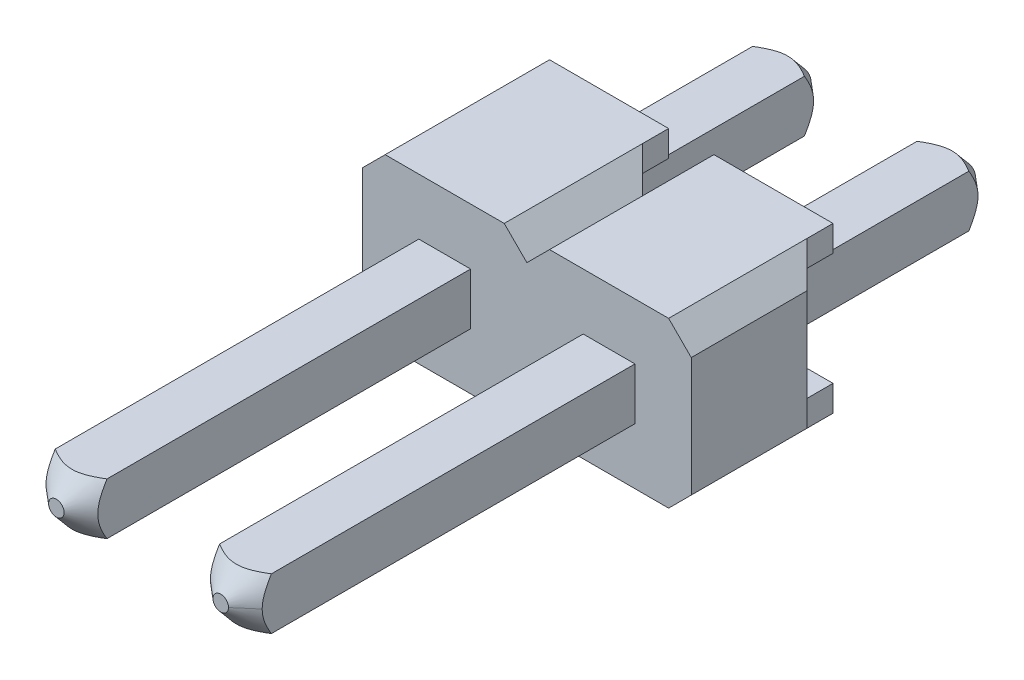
ISO-10303-21;
HEADER;
FILE_DESCRIPTION(('STEP AP214'),'2;1');
FILE_NAME('part.step','',(''),(''),'','','');
FILE_SCHEMA(('AUTOMOTIVE_DESIGN { 1 0 10303 214 1 1 1 1 }'));
ENDSEC;
DATA;
#1=APPLICATION_CONTEXT('core data for automotive mechanical design processes');
#2=APPLICATION_PROTOCOL_DEFINITION('international standard','automotive_design',2000,#1);
#3=PRODUCT_CONTEXT('',#1,'mechanical');
#4=PRODUCT('Part','Part','',(#3));
#5=PRODUCT_RELATED_PRODUCT_CATEGORY('part','',(#4));
#6=PRODUCT_DEFINITION_FORMATION('','',#4);
#7=PRODUCT_DEFINITION_CONTEXT('part definition',#1,'design');
#8=PRODUCT_DEFINITION('design','',#6,#7);
#9=PRODUCT_DEFINITION_SHAPE('','',#8);
#10=(LENGTH_UNIT() NAMED_UNIT(*) SI_UNIT(.MILLI.,.METRE.));
#11=(NAMED_UNIT(*) PLANE_ANGLE_UNIT() SI_UNIT($,.RADIAN.));
#12=(NAMED_UNIT(*) SI_UNIT($,.STERADIAN.) SOLID_ANGLE_UNIT());
#13=UNCERTAINTY_MEASURE_WITH_UNIT(LENGTH_MEASURE(1.E-05),#10,'distance_accuracy_value','');
#14=(GEOMETRIC_REPRESENTATION_CONTEXT(3) GLOBAL_UNCERTAINTY_ASSIGNED_CONTEXT((#13)) GLOBAL_UNIT_ASSIGNED_CONTEXT((#10,
#11,#12)) REPRESENTATION_CONTEXT('',''));
#15=CARTESIAN_POINT('',(0.,0.,0.));
#16=DIRECTION('',(0.,0.,1.));
#17=DIRECTION('',(1.,0.,0.));
#18=AXIS2_PLACEMENT_3D('',#15,#16,#17);
#19=CARTESIAN_POINT('',(0.,0.,-5.54));
#20=DIRECTION('',(0.,0.,-1.));
#21=DIRECTION('',(-1.,0.,0.));
#22=AXIS2_PLACEMENT_3D('',#19,#20,#21);
#23=PLANE('',#22);
#24=CARTESIAN_POINT('',(0.,0.,-5.53999999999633));
#25=DIRECTION('',(0.,0.,1.));
#26=DIRECTION('',(1.,0.,0.));
#27=AXIS2_PLACEMENT_3D('',#24,#25,#26);
#28=CIRCLE('',#27,0.12000000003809);
#29=CARTESIAN_POINT('',(0.12000000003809,0.,-5.53999999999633));
#30=VERTEX_POINT('',#29);
#31=EDGE_CURVE('E210',#30,#30,#28,.T.);
#32=ORIENTED_EDGE('',*,*,#31,.F.);
#33=EDGE_LOOP('',(#32));
#34=FACE_BOUND('',#33,.T.);
#35=ADVANCED_FACE('F16',(#34),#23,.T.);
#36=CARTESIAN_POINT('',(0.4,-0.4,6.));
#37=DIRECTION('',(0.,-1.,0.));
#38=DIRECTION('',(0.,0.,-1.));
#39=AXIS2_PLACEMENT_3D('',#36,#37,#38);
#40=PLANE('',#39);
#41=DIRECTION('',(0.,0.,-1.));
#42=VECTOR('',#41,1.);
#43=CARTESIAN_POINT('',(0.4,-0.4,6.));
#44=LINE('',#43,#42);
#45=CARTESIAN_POINT('',(0.4,-0.4,-2.1400000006));
#46=VERTEX_POINT('',#45);
#47=CARTESIAN_POINT('',(0.400000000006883,-0.4,-5.15798392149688));
#48=VERTEX_POINT('',#47);
#49=EDGE_CURVE('E216',#46,#48,#44,.T.);
#50=ORIENTED_EDGE('',*,*,#49,.F.);
#51=DIRECTION('',(1.,0.,0.));
#52=VECTOR('',#51,1.);
#53=CARTESIAN_POINT('',(0.4,-0.4,-2.1400000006));
#54=LINE('',#53,#52);
#55=CARTESIAN_POINT('',(-0.400000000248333,-0.4,-2.1400000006));
#56=VERTEX_POINT('',#55);
#57=EDGE_CURVE('E218',#46,#56,#54,.F.);
#58=ORIENTED_EDGE('',*,*,#57,.T.);
#59=DIRECTION('',(0.,0.,1.));
#60=VECTOR('',#59,1.);
#61=CARTESIAN_POINT('',(-0.4,-0.4,6.));
#62=LINE('',#61,#60);
#63=CARTESIAN_POINT('',(-0.400000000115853,-0.400000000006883,-5.15798392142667));
#64=VERTEX_POINT('',#63);
#65=EDGE_CURVE('E217',#64,#56,#62,.T.);
#66=ORIENTED_EDGE('',*,*,#65,.F.);
#67=CARTESIAN_POINT('',(-0.400000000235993,-0.400000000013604,-5.15798392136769));
#68=CARTESIAN_POINT('',(-0.377126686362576,-0.400000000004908,-5.17180892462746));
#69=CARTESIAN_POINT('',(-0.35399675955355,-0.400000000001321,-5.18526849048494));
#70=CARTESIAN_POINT('',(-0.306840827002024,-0.399999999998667,-5.21103624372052));
#71=CARTESIAN_POINT('',(-0.282808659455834,-0.39999999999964,-5.22333306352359));
#72=CARTESIAN_POINT('',(-0.23342868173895,-0.400000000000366,-5.24629257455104));
#73=CARTESIAN_POINT('',(-0.208064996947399,-0.400000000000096,-5.25692196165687));
#74=CARTESIAN_POINT('',(-0.156363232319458,-0.399999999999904,-5.27528238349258));
#75=CARTESIAN_POINT('',(-0.130029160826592,-0.399999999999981,-5.28302413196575));
#76=CARTESIAN_POINT('',(-0.0878269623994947,-0.400000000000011,-5.29206685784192));
#77=CARTESIAN_POINT('',(-0.072246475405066,-0.400000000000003,-5.29470703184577));
#78=CARTESIAN_POINT('',(-0.0408966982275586,-0.399999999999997,-5.29846904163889));
#79=CARTESIAN_POINT('',(-0.0251273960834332,-0.399999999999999,-5.29959078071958));
#80=CARTESIAN_POINT('',(0.00626630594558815,-0.400000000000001,-5.3002186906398));
#81=CARTESIAN_POINT('',(0.0218903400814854,-0.4,-5.29974289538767));
#82=CARTESIAN_POINT('',(0.0530203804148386,-0.4,-5.29725744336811));
#83=CARTESIAN_POINT('',(0.0685263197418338,-0.4,-5.29524697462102));
#84=CARTESIAN_POINT('',(0.122835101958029,-0.4,-5.28568142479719));
#85=CARTESIAN_POINT('',(0.160972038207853,-0.4,-5.27434970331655));
#86=CARTESIAN_POINT('',(0.23539283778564,-0.4,-5.24610140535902));
#87=CARTESIAN_POINT('',(0.271650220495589,-0.4,-5.22912185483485));
#88=CARTESIAN_POINT('',(0.322961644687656,-0.4,-5.20232251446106));
#89=CARTESIAN_POINT('',(0.33867558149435,-0.4,-5.19372216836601));
#90=CARTESIAN_POINT('',(0.369628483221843,-0.4,-5.17613400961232));
#91=CARTESIAN_POINT('',(0.384870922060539,-0.4,-5.16715232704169));
#92=CARTESIAN_POINT('',(0.40000000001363,-0.4,-5.15798392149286));
#93=B_SPLINE_CURVE_WITH_KNOTS('',3,(#67,#68,#69,#70,#71,#72,#73,#74,#75,#76,#77,#78,#79,#80,#81,
#82,#83,#84,#85,#86,#87,#88,#89,#90,#91,#92),.UNSPECIFIED.,.F.,.F.,(4,2,2,2,2,2,2,2,2,2,2,2,4),
(0.,0.0802237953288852,0.161164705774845,0.24355887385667,0.325644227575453,0.37298799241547,
0.420334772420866,0.467148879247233,0.513987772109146,0.632514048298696,0.75240887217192,
0.806143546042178,0.859211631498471),.UNSPECIFIED.);
#94=EDGE_CURVE('E19',#64,#48,#93,.T.);
#95=ORIENTED_EDGE('',*,*,#94,.T.);
#96=EDGE_LOOP('',(#50,#58,#66,#95));
#97=FACE_BOUND('',#96,.T.);
#98=ADVANCED_FACE('F215',(#97),#40,.T.);
#99=CARTESIAN_POINT('',(0.,0.,-5.54));
#100=DIRECTION('',(0.,0.,-1.));
#101=DIRECTION('',(-1.,0.,0.));
#102=AXIS2_PLACEMENT_3D('',#99,#100,#101);
#103=PLANE('',#102);
#104=CARTESIAN_POINT('',(2.54,0.,-5.53999999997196));
#105=DIRECTION('',(0.,0.,1.));
#106=DIRECTION('',(1.,0.,0.));
#107=AXIS2_PLACEMENT_3D('',#104,#105,#106);
#108=CIRCLE('',#107,0.120000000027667);
#109=CARTESIAN_POINT('',(2.41999999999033,0.,-5.5399999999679));
#110=VERTEX_POINT('',#109);
#111=CARTESIAN_POINT('',(2.66000000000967,0.,-5.53999999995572));
#112=VERTEX_POINT('',#111);
#113=EDGE_CURVE('E1018',#110,#112,#108,.T.);
#114=ORIENTED_EDGE('',*,*,#113,.F.);
#115=CARTESIAN_POINT('',(2.54,0.,-5.53999999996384));
#116=DIRECTION('',(0.,0.,1.));
#117=DIRECTION('',(1.,0.,0.));
#118=AXIS2_PLACEMENT_3D('',#115,#116,#117);
#119=CIRCLE('',#118,0.119999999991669);
#120=EDGE_CURVE('E1066',#112,#110,#119,.T.);
#121=ORIENTED_EDGE('',*,*,#120,.F.);
#122=EDGE_LOOP('',(#114,#121));
#123=FACE_BOUND('',#122,.T.);
#124=ADVANCED_FACE('F1042',(#123),#103,.T.);
#125=CARTESIAN_POINT('',(2.54,0.,-5.15569186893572));
#126=DIRECTION('',(0.,0.,1.));
#127=DIRECTION('',(1.,0.,0.));
#128=AXIS2_PLACEMENT_3D('',#125,#126,#127);
#129=CONICAL_SURFACE('',#128,0.568359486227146,0.862170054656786);
#130=CARTESIAN_POINT('',(2.42000000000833,0.,-5.53999999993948));
#131=CARTESIAN_POINT('',(2.40833081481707,5.64494977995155E-10,-5.5299978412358));
#132=CARTESIAN_POINT('',(2.39666162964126,1.29366990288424E-09,-5.51999568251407));
#133=CARTESIAN_POINT('',(2.37332325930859,3.08137958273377E-09,-5.49999136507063));
#134=CARTESIAN_POINT('',(2.36165407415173,4.13991433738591E-09,-5.48998920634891));
#135=CARTESIAN_POINT('',(2.33831570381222,6.58634358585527E-09,-5.46998488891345));
#136=CARTESIAN_POINT('',(2.32664651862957,7.97423807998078E-09,-5.45998273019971));
#137=CARTESIAN_POINT('',(2.30330814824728,1.10793870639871E-08,-5.439978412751));
#138=CARTESIAN_POINT('',(2.29163896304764,1.27966415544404E-08,-5.42997625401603));
#139=CARTESIAN_POINT('',(2.26830059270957,1.65605101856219E-08,-5.40997193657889));
#140=CARTESIAN_POINT('',(2.25663140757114,1.86071243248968E-08,-5.39996977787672));
#141=CARTESIAN_POINT('',(2.23329303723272,2.30297125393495E-08,-5.37996546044));
#142=CARTESIAN_POINT('',(2.22162385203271,2.54056866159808E-08,-5.36996330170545));
#143=CARTESIAN_POINT('',(2.1982854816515,3.04869945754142E-08,-5.34995898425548));
#144=CARTESIAN_POINT('',(2.18661629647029,3.31923284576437E-08,-5.33995682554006));
#145=CARTESIAN_POINT('',(2.16327792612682,3.89323560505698E-08,-5.31995250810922));
#146=CARTESIAN_POINT('',(2.15160874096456,4.1967049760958E-08,-5.3099503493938));
#147=CARTESIAN_POINT('',(2.13993955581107,4.51664233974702E-08,-5.29994819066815));
#148=B_SPLINE_CURVE_WITH_KNOTS('',3,(#130,#131,#132,#133,#134,#135,#136,#137,#138,#139,#140,
#141,#142,#143,#144,#145,#146,#147),.UNSPECIFIED.,.F.,.F.,(4,2,2,2,2,2,2,2,4),(0.,
0.0461076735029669,0.0922153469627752,0.138323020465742,0.184430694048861,0.230538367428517,
0.276646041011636,0.322753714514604,0.368861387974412),.UNSPECIFIED.);
#149=CARTESIAN_POINT('',(2.14000000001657,4.51606346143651E-08,-5.29999999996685));
#150=VERTEX_POINT('',#149);
#151=EDGE_CURVE('E236',#110,#150,#148,.T.);
#152=ORIENTED_EDGE('',*,*,#151,.F.);
#153=ORIENTED_EDGE('',*,*,#113,.T.);
#154=CARTESIAN_POINT('',(2.94006044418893,0.,-5.29994819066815));
#155=CARTESIAN_POINT('',(2.92839125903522,-5.65450743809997E-10,-5.30995034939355));
#156=CARTESIAN_POINT('',(2.91672207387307,-9.36539177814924E-10,-5.31995250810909));
#157=CARTESIAN_POINT('',(2.89338370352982,-1.3728968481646E-09,-5.33995682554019));
#158=CARTESIAN_POINT('',(2.88171451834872,-1.43816608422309E-09,-5.34995898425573));
#159=CARTESIAN_POINT('',(2.85837614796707,-1.3457905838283E-09,-5.36996330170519));
#160=CARTESIAN_POINT('',(2.84670696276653,-1.18814584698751E-09,-5.37996546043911));
#161=CARTESIAN_POINT('',(2.82336859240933,-6.78353210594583E-10,-5.39996977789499));
#162=CARTESIAN_POINT('',(2.81169940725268,-3.26205311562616E-10,-5.40997193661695));
#163=CARTESIAN_POINT('',(2.78105421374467,5.30463153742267E-10,-5.43623924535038));
#164=CARTESIAN_POINT('',(2.76207820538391,9.9232338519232E-10,-5.45250439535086));
#165=CARTESIAN_POINT('',(2.72899740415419,1.31742407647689E-09,-5.48085936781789));
#166=CARTESIAN_POINT('',(2.71489261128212,1.30389741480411E-09,-5.4929491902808));
#167=CARTESIAN_POINT('',(2.69155424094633,1.20526521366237E-09,-5.5129535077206));
#168=CARTESIAN_POINT('',(2.68232066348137,1.14649343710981E-09,-5.52086800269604));
#169=CARTESIAN_POINT('',(2.66872472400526,5.95720675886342E-10,-5.53252166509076));
#170=CARTESIAN_POINT('',(2.6643623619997,3.4862870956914E-10,-5.53626083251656));
#171=CARTESIAN_POINT('',(2.65999999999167,0.,-5.53999999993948));
#172=B_SPLINE_CURVE_WITH_KNOTS('',3,(#154,#155,#156,#157,#158,#159,#160,#161,#162,#163,#164,
#165,#166,#167,#168,#169,#170,#171),.UNSPECIFIED.,.F.,.F.,(4,2,2,2,2,2,2,2,4),(0.,
0.0461076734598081,0.092215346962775,0.138323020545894,0.184430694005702,0.259409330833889,
0.315140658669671,0.351624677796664,0.368861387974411),.UNSPECIFIED.);
#173=CARTESIAN_POINT('',(2.94,2.25011265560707E-08,-5.29999999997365));
#174=VERTEX_POINT('',#173);
#175=EDGE_CURVE('E242',#174,#112,#172,.T.);
#176=ORIENTED_EDGE('',*,*,#175,.F.);
#177=CARTESIAN_POINT('',(2.94000000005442,-0.400000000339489,-5.15798392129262));
#178=CARTESIAN_POINT('',(2.9400000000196,-0.376489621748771,-5.17218931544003));
#179=CARTESIAN_POINT('',(2.94000000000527,-0.352708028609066,-5.18601509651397));
#180=CARTESIAN_POINT('',(2.93999999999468,-0.304188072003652,-5.21243742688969));
#181=CARTESIAN_POINT('',(2.9399999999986,-0.279442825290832,-5.22502122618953));
#182=CARTESIAN_POINT('',(2.94000000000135,-0.229950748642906,-5.24777046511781));
#183=CARTESIAN_POINT('',(2.94000000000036,-0.20523804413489,-5.25800831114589));
#184=CARTESIAN_POINT('',(2.93999999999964,-0.154906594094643,-5.27571068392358));
#185=CARTESIAN_POINT('',(2.93999999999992,-0.129291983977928,-5.28318642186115));
#186=CARTESIAN_POINT('',(2.94000000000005,-0.0863995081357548,-5.29236991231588));
#187=CARTESIAN_POINT('',(2.94000000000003,-0.0693614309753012,-5.29518175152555));
#188=CARTESIAN_POINT('',(2.93999999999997,-0.034891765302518,-5.29902032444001));
#189=CARTESIAN_POINT('',(2.93999999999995,-0.0174579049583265,-5.30002631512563));
#190=CARTESIAN_POINT('',(2.94,2.25011255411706E-08,-5.29999999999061));
#191=B_SPLINE_CURVE_WITH_KNOTS('',3,(#177,#178,#179,#180,#181,#182,#183,#184,#185,#186,#187,
#188,#189,#190),.UNSPECIFIED.,.F.,.F.,(4,2,2,2,2,2,4),(0.,0.0824580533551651,0.165689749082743,
0.245833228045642,0.325647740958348,0.377362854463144,0.429668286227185),.UNSPECIFIED.);
#192=CARTESIAN_POINT('',(2.93999999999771,-0.4000000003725,-5.1579839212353));
#193=VERTEX_POINT('',#192);
#194=EDGE_CURVE('E269',#193,#174,#191,.T.);
#195=ORIENTED_EDGE('',*,*,#194,.F.);
#196=CARTESIAN_POINT('',(2.14000000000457,-0.4,-5.15798392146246));
#197=CARTESIAN_POINT('',(2.16287331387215,-0.4,-5.17180892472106));
#198=CARTESIAN_POINT('',(2.18600324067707,-0.4,-5.18526849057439));
#199=CARTESIAN_POINT('',(2.2331591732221,-0.4,-5.21103624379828));
#200=CARTESIAN_POINT('',(2.25719134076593,-0.4,-5.22333306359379));
#201=CARTESIAN_POINT('',(2.3065713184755,-0.4,-5.24629257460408));
#202=CARTESIAN_POINT('',(2.33193500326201,-0.4,-5.25692196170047));
#203=CARTESIAN_POINT('',(2.38363676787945,-0.4,-5.2752823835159));
#204=CARTESIAN_POINT('',(2.40997083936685,-0.4,-5.28302413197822));
#205=CARTESIAN_POINT('',(2.45217303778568,-0.4,-5.29206685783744));
#206=CARTESIAN_POINT('',(2.46775352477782,-0.4,-5.29470703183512));
#207=CARTESIAN_POINT('',(2.49910330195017,-0.4,-5.29846904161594));
#208=CARTESIAN_POINT('',(2.51487260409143,-0.4,-5.29959078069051));
#209=CARTESIAN_POINT('',(2.54626630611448,-0.4,-5.30021869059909));
#210=CARTESIAN_POINT('',(2.56189034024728,-0.4,-5.2997428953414));
#211=CARTESIAN_POINT('',(2.59302038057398,-0.4,-5.29725744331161));
#212=CARTESIAN_POINT('',(2.60852631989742,-0.4,-5.29524697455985));
#213=CARTESIAN_POINT('',(2.66283510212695,-0.4,-5.28568142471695));
#214=CARTESIAN_POINT('',(2.70097203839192,-0.4,-5.274349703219));
#215=CARTESIAN_POINT('',(2.77539283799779,-0.4,-5.24610140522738));
#216=CARTESIAN_POINT('',(2.8116502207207,-0.4,-5.22912185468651));
#217=CARTESIAN_POINT('',(2.86296164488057,-0.4,-5.20232251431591));
#218=CARTESIAN_POINT('',(2.87867558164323,-0.4,-5.19372216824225));
#219=CARTESIAN_POINT('',(2.90962848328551,-0.4,-5.17613400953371));
#220=CARTESIAN_POINT('',(2.924870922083,-0.4,-5.16715232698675));
#221=CARTESIAN_POINT('',(2.93999999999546,-0.4,-5.15798392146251));
#222=B_SPLINE_CURVE_WITH_KNOTS('',3,(#196,#197,#198,#199,#200,#201,#202,#203,#204,#205,#206,
#207,#208,#209,#210,#211,#212,#213,#214,#215,#216,#217,#218,#219,#220,#221),.UNSPECIFIED.,.F.,
.F.,(4,2,2,2,2,2,2,2,2,2,2,2,4),(0.,0.0802237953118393,0.161164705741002,0.243558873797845,
0.325644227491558,0.372987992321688,0.420334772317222,0.467148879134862,0.513987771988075,
0.632514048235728,0.752408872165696,0.806143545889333,0.859211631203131),.UNSPECIFIED.);
#223=CARTESIAN_POINT('',(2.14000000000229,-0.399999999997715,-5.15798392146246));
#224=VERTEX_POINT('',#223);
#225=EDGE_CURVE('E224',#224,#193,#222,.T.);
#226=ORIENTED_EDGE('',*,*,#225,.F.);
#227=CARTESIAN_POINT('',(2.14,4.51714144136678E-08,-5.2999999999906));
#228=CARTESIAN_POINT('',(2.14,-0.0141338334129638,-5.30001281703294));
#229=CARTESIAN_POINT('',(2.14,-0.0282597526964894,-5.29935811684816));
#230=CARTESIAN_POINT('',(2.14,-0.0563716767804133,-5.2968155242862));
#231=CARTESIAN_POINT('',(2.14,-0.0703579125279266,-5.29493021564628));
#232=CARTESIAN_POINT('',(2.14,-0.0979157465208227,-5.29006466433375));
#233=CARTESIAN_POINT('',(2.14,-0.111490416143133,-5.28710147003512));
#234=CARTESIAN_POINT('',(2.14,-0.138399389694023,-5.28022435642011));
#235=CARTESIAN_POINT('',(2.14,-0.151733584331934,-5.27631001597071));
#236=CARTESIAN_POINT('',(2.14,-0.185411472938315,-5.26530695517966));
#237=CARTESIAN_POINT('',(2.14,-0.205571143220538,-5.25765725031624));
#238=CARTESIAN_POINT('',(2.14,-0.245304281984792,-5.24093632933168));
#239=CARTESIAN_POINT('',(2.14,-0.264877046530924,-5.23186348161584));
#240=CARTESIAN_POINT('',(2.14,-0.304004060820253,-5.21244142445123));
#241=CARTESIAN_POINT('',(2.14,-0.32354476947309,-5.20206529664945));
#242=CARTESIAN_POINT('',(2.14,-0.36211441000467,-5.18054069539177));
#243=CARTESIAN_POINT('',(2.14,-0.381144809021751,-5.1693948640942));
#244=CARTESIAN_POINT('',(2.14,-0.399999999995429,-5.15798392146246));
#245=B_SPLINE_CURVE_WITH_KNOTS('',3,(#227,#228,#229,#230,#231,#232,#233,#234,#235,#236,#237,
#238,#239,#240,#241,#242,#243,#244),.UNSPECIFIED.,.F.,.F.,(4,2,2,2,2,2,2,2,4),(0.,
0.0423737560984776,0.0846588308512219,0.126302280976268,0.167964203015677,0.232570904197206,
0.297252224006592,0.363604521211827,0.429739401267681),.UNSPECIFIED.);
#246=EDGE_CURVE('E363',#150,#224,#245,.T.);
#247=ORIENTED_EDGE('',*,*,#246,.F.);
#248=EDGE_LOOP('',(#152,#153,#176,#195,#226,#247));
#249=FACE_BOUND('',#248,.T.);
#250=ADVANCED_FACE('F1038',(#249),#129,.T.);
#251=CARTESIAN_POINT('',(2.94,-0.4,6.));
#252=DIRECTION('',(0.,-1.,0.));
#253=DIRECTION('',(0.,0.,-1.));
#254=AXIS2_PLACEMENT_3D('',#251,#252,#253);
#255=PLANE('',#254);
#256=DIRECTION('',(0.,0.,-1.));
#257=VECTOR('',#256,1.);
#258=CARTESIAN_POINT('',(2.94,-0.400000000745,6.));
#259=LINE('',#258,#257);
#260=CARTESIAN_POINT('',(2.94,-0.400000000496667,-2.1400000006));
#261=VERTEX_POINT('',#260);
#262=EDGE_CURVE('E266',#261,#193,#259,.T.);
#263=ORIENTED_EDGE('',*,*,#262,.F.);
#264=DIRECTION('',(1.,0.,0.));
#265=VECTOR('',#264,1.);
#266=CARTESIAN_POINT('',(2.94,-0.4,-2.1400000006));
#267=LINE('',#266,#265);
#268=CARTESIAN_POINT('',(2.14,-0.4,-2.1400000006));
#269=VERTEX_POINT('',#268);
#270=EDGE_CURVE('E221',#261,#269,#267,.F.);
#271=ORIENTED_EDGE('',*,*,#270,.T.);
#272=DIRECTION('',(0.,0.,1.));
#273=VECTOR('',#272,1.);
#274=CARTESIAN_POINT('',(2.14,-0.4,6.));
#275=LINE('',#274,#273);
#276=EDGE_CURVE('E360',#224,#269,#275,.T.);
#277=ORIENTED_EDGE('',*,*,#276,.F.);
#278=ORIENTED_EDGE('',*,*,#225,.T.);
#279=EDGE_LOOP('',(#263,#271,#277,#278));
#280=FACE_BOUND('',#279,.T.);
#281=ADVANCED_FACE('F1036',(#280),#255,.T.);
#282=CARTESIAN_POINT('',(0.4,0.4,6.));
#283=DIRECTION('',(1.,0.,0.));
#284=DIRECTION('',(0.,0.,-1.));
#285=AXIS2_PLACEMENT_3D('',#282,#283,#284);
#286=PLANE('',#285);
#287=DIRECTION('',(0.,0.,1.));
#288=VECTOR('',#287,1.);
#289=CARTESIAN_POINT('',(0.4,0.4,6.));
#290=LINE('',#289,#288);
#291=CARTESIAN_POINT('',(0.4,0.4,-2.1400000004));
#292=VERTEX_POINT('',#291);
#293=CARTESIAN_POINT('',(0.4,0.39999999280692,-5.15798392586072));
#294=VERTEX_POINT('',#293);
#295=EDGE_CURVE('E345',#292,#294,#290,.F.);
#296=ORIENTED_EDGE('',*,*,#295,.F.);
#297=DIRECTION('',(0.,1.,0.));
#298=VECTOR('',#297,1.);
#299=CARTESIAN_POINT('',(0.4,0.4,-2.1400000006));
#300=LINE('',#299,#298);
#301=EDGE_CURVE('E211',#292,#46,#300,.F.);
#302=ORIENTED_EDGE('',*,*,#301,.T.);
#303=ORIENTED_EDGE('',*,*,#49,.T.);
#304=CARTESIAN_POINT('',(0.399999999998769,0.399999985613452,-5.15798393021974));
#305=CARTESIAN_POINT('',(0.399999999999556,0.377172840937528,-5.17178113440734));
#306=CARTESIAN_POINT('',(0.39999999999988,0.354090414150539,-5.18521408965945));
#307=CARTESIAN_POINT('',(0.400000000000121,0.307025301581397,-5.21093880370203));
#308=CARTESIAN_POINT('',(0.400000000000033,0.28303625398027,-5.22321882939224));
#309=CARTESIAN_POINT('',(0.399999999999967,0.233652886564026,-5.24619679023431));
#310=CARTESIAN_POINT('',(0.399999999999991,0.208239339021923,-5.25685443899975));
#311=CARTESIAN_POINT('',(0.400000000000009,0.156447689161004,-5.2752579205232));
#312=CARTESIAN_POINT('',(0.400000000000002,0.130074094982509,-5.28301581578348));
#313=CARTESIAN_POINT('',(0.399999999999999,0.0862477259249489,-5.29240441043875));
#314=CARTESIAN_POINT('',(0.4,0.0690555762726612,-5.29523812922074));
#315=CARTESIAN_POINT('',(0.4,0.0345770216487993,-5.2990323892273));
#316=CARTESIAN_POINT('',(0.4,0.0172919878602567,-5.3000051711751));
#317=CARTESIAN_POINT('',(0.4,-0.0278438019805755,-5.29999167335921));
#318=CARTESIAN_POINT('',(0.4,-0.055705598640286,-5.29744770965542));
#319=CARTESIAN_POINT('',(0.4,-0.110883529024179,-5.2878431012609));
#320=CARTESIAN_POINT('',(0.4,-0.138190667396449,-5.28073454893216));
#321=CARTESIAN_POINT('',(0.4,-0.185953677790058,-5.26512991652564));
#322=CARTESIAN_POINT('',(0.4,-0.206624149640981,-5.25725723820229));
#323=CARTESIAN_POINT('',(0.4,-0.247360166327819,-5.24002456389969));
#324=CARTESIAN_POINT('',(0.4,-0.26742487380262,-5.23066261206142));
#325=CARTESIAN_POINT('',(0.4,-0.306500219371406,-5.21112938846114));
#326=CARTESIAN_POINT('',(0.4,-0.325524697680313,-5.20098531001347));
#327=CARTESIAN_POINT('',(0.4,-0.363086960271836,-5.17997176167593));
#328=CARTESIAN_POINT('',(0.4,-0.381626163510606,-5.16910484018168));
#329=CARTESIAN_POINT('',(0.4,-0.400000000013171,-5.15798392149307));
#330=B_SPLINE_CURVE_WITH_KNOTS('',3,(#304,#305,#306,#307,#308,#309,#310,#311,#312,#313,#314,
#315,#316,#317,#318,#319,#320,#321,#322,#323,#324,#325,#326,#327,#328,#329),.UNSPECIFIED.,.F.,
.F.,(4,2,2,2,2,2,2,2,2,2,2,2,4),(0.,0.0800612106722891,0.160864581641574,0.243427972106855,
0.325643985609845,0.377826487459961,0.429664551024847,0.513135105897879,0.597496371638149,
0.663786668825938,0.730164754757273,0.794826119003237,0.859270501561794),.UNSPECIFIED.);
#331=EDGE_CURVE('E200',#294,#48,#330,.T.);
#332=ORIENTED_EDGE('',*,*,#331,.F.);
#333=EDGE_LOOP('',(#296,#302,#303,#332));
#334=FACE_BOUND('',#333,.T.);
#335=ADVANCED_FACE('F220',(#334),#286,.T.);
#336=CARTESIAN_POINT('',(0.,0.,-5.15569186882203));
#337=DIRECTION('',(0.,0.,1.));
#338=DIRECTION('',(1.,0.,0.));
#339=AXIS2_PLACEMENT_3D('',#336,#337,#338);
#340=CONICAL_SURFACE('',#339,0.568359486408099,0.862170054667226);
#341=CARTESIAN_POINT('',(-0.399999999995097,0.40000000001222,-5.15798392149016));
#342=CARTESIAN_POINT('',(-0.39999999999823,0.377172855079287,-5.17178112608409));
#343=CARTESIAN_POINT('',(-0.399999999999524,0.35409042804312,-5.1852140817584));
#344=CARTESIAN_POINT('',(-0.400000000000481,0.307025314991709,-5.21093879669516));
#345=CARTESIAN_POINT('',(-0.40000000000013,0.283036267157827,-5.22321882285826));
#346=CARTESIAN_POINT('',(-0.399999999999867,0.233652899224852,-5.24619678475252));
#347=CARTESIAN_POINT('',(-0.399999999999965,0.208239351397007,-5.25685443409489));
#348=CARTESIAN_POINT('',(-0.400000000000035,0.156447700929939,-5.27525791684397));
#349=CARTESIAN_POINT('',(-0.400000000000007,0.130074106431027,-5.28301581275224));
#350=CARTESIAN_POINT('',(-0.399999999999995,0.0862477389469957,-5.29240440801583));
#351=CARTESIAN_POINT('',(-0.399999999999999,0.0690555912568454,-5.29523812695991));
#352=CARTESIAN_POINT('',(-0.400000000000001,0.0345770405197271,-5.29903238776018));
#353=CARTESIAN_POINT('',(-0.4,0.0172920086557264,-5.30000517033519));
#354=CARTESIAN_POINT('',(-0.399999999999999,-0.0278437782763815,-5.29999167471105));
#355=CARTESIAN_POINT('',(-0.4,-0.0557055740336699,-5.29744771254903));
#356=CARTESIAN_POINT('',(-0.4,-0.110883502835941,-5.28784310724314));
#357=CARTESIAN_POINT('',(-0.4,-0.138190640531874,-5.28073455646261));
#358=CARTESIAN_POINT('',(-0.4,-0.185953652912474,-5.26512992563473));
#359=CARTESIAN_POINT('',(-0.4,-0.206624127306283,-5.25725724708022));
#360=CARTESIAN_POINT('',(-0.4,-0.247360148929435,-5.24002457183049));
#361=CARTESIAN_POINT('',(-0.4,-0.267424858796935,-5.23066261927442));
#362=CARTESIAN_POINT('',(-0.4,-0.306500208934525,-5.21112939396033));
#363=CARTESIAN_POINT('',(-0.4,-0.325524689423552,-5.20098531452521));
#364=CARTESIAN_POINT('',(-0.4,-0.363086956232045,-5.17997176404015));
#365=CARTESIAN_POINT('',(-0.4,-0.381626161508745,-5.16910484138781));
#366=CARTESIAN_POINT('',(-0.4,-0.400000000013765,-5.15798392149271));
#367=B_SPLINE_CURVE_WITH_KNOTS('',3,(#341,#342,#343,#344,#345,#346,#347,#348,#349,#350,#351,
#352,#353,#354,#355,#356,#357,#358,#359,#360,#361,#362,#363,#364,#365,#366),.UNSPECIFIED.,.F.,
.F.,(4,2,2,2,2,2,2,2,2,2,2,2,4),(0.,0.0800612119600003,0.160864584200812,0.243427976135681,
0.325643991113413,0.377826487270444,0.429664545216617,0.513135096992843,0.597496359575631,
0.663786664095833,0.730164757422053,0.794826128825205,0.859270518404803),.UNSPECIFIED.);
#368=CARTESIAN_POINT('',(-0.400000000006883,0.400000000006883,-5.15798392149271));
#369=VERTEX_POINT('',#368);
#370=EDGE_CURVE('E194',#369,#64,#367,.T.);
#371=ORIENTED_EDGE('',*,*,#370,.F.);
#372=CARTESIAN_POINT('',(0.399999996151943,0.4,-5.15798392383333));
#373=CARTESIAN_POINT('',(0.377126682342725,0.4,-5.17180892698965));
#374=CARTESIAN_POINT('',(0.353996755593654,0.4,-5.18526849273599));
#375=CARTESIAN_POINT('',(0.306840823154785,0.4,-5.21103624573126));
#376=CARTESIAN_POINT('',(0.282808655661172,0.4,-5.22333306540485));
#377=CARTESIAN_POINT('',(0.233428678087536,0.4,-5.24629257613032));
#378=CARTESIAN_POINT('',(0.208064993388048,0.4,-5.25692196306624));
#379=CARTESIAN_POINT('',(0.156363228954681,0.4,-5.27528238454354));
#380=CARTESIAN_POINT('',(0.130029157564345,0.4,-5.2830241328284));
#381=CARTESIAN_POINT('',(0.0878269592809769,0.4,-5.29206685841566));
#382=CARTESIAN_POINT('',(0.0722464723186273,0.4,-5.29470703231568));
#383=CARTESIAN_POINT('',(0.0408966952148,0.4,-5.29846904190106));
#384=CARTESIAN_POINT('',(0.0251273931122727,0.4,-5.29959078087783));
#385=CARTESIAN_POINT('',(-0.00626630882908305,0.4,-5.30021869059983));
#386=CARTESIAN_POINT('',(-0.021890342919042,0.4,-5.29974289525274));
#387=CARTESIAN_POINT('',(-0.0530203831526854,0.4,-5.29725744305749));
#388=CARTESIAN_POINT('',(-0.0685263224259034,0.4,-5.29524697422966));
#389=CARTESIAN_POINT('',(-0.122835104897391,0.4,-5.28568142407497));
#390=CARTESIAN_POINT('',(-0.160972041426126,0.4,-5.27434970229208));
#391=CARTESIAN_POINT('',(-0.23539284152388,0.4,-5.24610140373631));
#392=CARTESIAN_POINT('',(-0.271650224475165,0.4,-5.22912185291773));
#393=CARTESIAN_POINT('',(-0.322961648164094,0.4,-5.20232251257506));
#394=CARTESIAN_POINT('',(-0.338675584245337,0.4,-5.193722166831));
#395=CARTESIAN_POINT('',(-0.369628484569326,0.4,-5.17613400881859));
#396=CARTESIAN_POINT('',(-0.384870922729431,0.4,-5.16715232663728));
#397=CARTESIAN_POINT('',(-0.40000000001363,0.4,-5.15798392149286));
#398=B_SPLINE_CURVE_WITH_KNOTS('',3,(#372,#373,#374,#375,#376,#377,#378,#379,#380,#381,#382,
#383,#384,#385,#386,#387,#388,#389,#390,#391,#392,#393,#394,#395,#396,#397),.UNSPECIFIED.,.F.,
.F.,(4,2,2,2,2,2,2,2,2,2,2,2,4),(0.,0.0802237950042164,0.161164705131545,0.243558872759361,
0.325644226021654,0.372987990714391,0.420334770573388,0.467148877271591,0.513987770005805,
0.632514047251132,0.752408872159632,0.806143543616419,0.85921162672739),.UNSPECIFIED.);
#399=EDGE_CURVE('E206',#294,#369,#398,.T.);
#400=ORIENTED_EDGE('',*,*,#399,.F.);
#401=ORIENTED_EDGE('',*,*,#331,.T.);
#402=ORIENTED_EDGE('',*,*,#94,.F.);
#403=EDGE_LOOP('',(#371,#400,#401,#402));
#404=FACE_BOUND('',#403,.T.);
#405=ORIENTED_EDGE('',*,*,#31,.T.);
#406=EDGE_LOOP('',(#405));
#407=FACE_BOUND('',#406,.T.);
#408=ADVANCED_FACE('F202',(#404,#407),#340,.T.);
#409=CARTESIAN_POINT('',(-0.4,-0.4,6.));
#410=DIRECTION('',(-1.,0.,0.));
#411=DIRECTION('',(0.,0.,1.));
#412=AXIS2_PLACEMENT_3D('',#409,#410,#411);
#413=PLANE('',#412);
#414=ORIENTED_EDGE('',*,*,#65,.T.);
#415=DIRECTION('',(0.,1.,0.));
#416=VECTOR('',#415,1.);
#417=CARTESIAN_POINT('',(-0.4,-0.4,-2.1400000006));
#418=LINE('',#417,#416);
#419=CARTESIAN_POINT('',(-0.4,0.4,-2.1400000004));
#420=VERTEX_POINT('',#419);
#421=EDGE_CURVE('E270',#56,#420,#418,.T.);
#422=ORIENTED_EDGE('',*,*,#421,.T.);
#423=DIRECTION('',(0.,0.,1.));
#424=VECTOR('',#423,1.);
#425=CARTESIAN_POINT('',(-0.4,0.4,6.));
#426=LINE('',#425,#424);
#427=EDGE_CURVE('E340',#369,#420,#426,.T.);
#428=ORIENTED_EDGE('',*,*,#427,.F.);
#429=ORIENTED_EDGE('',*,*,#370,.T.);
#430=EDGE_LOOP('',(#414,#422,#428,#429));
#431=FACE_BOUND('',#430,.T.);
#432=ADVANCED_FACE('F1083',(#431),#413,.T.);
#433=CARTESIAN_POINT('',(2.94,0.4,6.));
#434=DIRECTION('',(1.,0.,0.));
#435=DIRECTION('',(0.,0.,-1.));
#436=AXIS2_PLACEMENT_3D('',#433,#434,#435);
#437=PLANE('',#436);
#438=DIRECTION('',(0.,0.,1.));
#439=VECTOR('',#438,1.);
#440=CARTESIAN_POINT('',(2.94000000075,0.4,6.));
#441=LINE('',#440,#439);
#442=CARTESIAN_POINT('',(2.940000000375,0.4,-2.1400000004));
#443=VERTEX_POINT('',#442);
#444=CARTESIAN_POINT('',(2.940000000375,0.39999999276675,-5.15798392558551));
#445=VERTEX_POINT('',#444);
#446=EDGE_CURVE('E321',#443,#445,#441,.F.);
#447=ORIENTED_EDGE('',*,*,#446,.F.);
#448=DIRECTION('',(0.,1.,0.));
#449=VECTOR('',#448,1.);
#450=CARTESIAN_POINT('',(2.94,0.4,-2.1400000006));
#451=LINE('',#450,#449);
#452=EDGE_CURVE('E241',#443,#261,#451,.F.);
#453=ORIENTED_EDGE('',*,*,#452,.T.);
#454=ORIENTED_EDGE('',*,*,#262,.T.);
#455=ORIENTED_EDGE('',*,*,#194,.T.);
#456=CARTESIAN_POINT('',(2.94,0.399999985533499,-5.15798393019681));
#457=CARTESIAN_POINT('',(2.94,0.37648960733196,-5.17218932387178));
#458=CARTESIAN_POINT('',(2.94,0.35270801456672,-5.18601510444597));
#459=CARTESIAN_POINT('',(2.94,0.304188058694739,-5.21243743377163));
#460=CARTESIAN_POINT('',(2.94,0.279442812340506,-5.22502123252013));
#461=CARTESIAN_POINT('',(2.94,0.229950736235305,-5.24777047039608));
#462=CARTESIAN_POINT('',(2.94,0.205238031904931,-5.25800831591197));
#463=CARTESIAN_POINT('',(2.94,0.15490658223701,-5.27571068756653));
#464=CARTESIAN_POINT('',(2.94,0.129291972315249,-5.28318642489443));
#465=CARTESIAN_POINT('',(2.94,0.0863995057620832,-5.292369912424));
#466=CARTESIAN_POINT('',(2.94,0.0693614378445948,-5.29518175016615));
#467=CARTESIAN_POINT('',(2.94,0.0348917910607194,-5.2990203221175));
#468=CARTESIAN_POINT('',(2.94,0.0174579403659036,-5.30002631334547));
#469=CARTESIAN_POINT('',(2.94,2.25011253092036E-08,-5.2999999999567));
#470=B_SPLINE_CURVE_WITH_KNOTS('',3,(#456,#457,#458,#459,#460,#461,#462,#463,#464,#465,#466,
#467,#468,#469),.UNSPECIFIED.,.F.,.F.,(4,2,2,2,2,2,4),(0.,0.0824580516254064,0.165689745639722,
0.245833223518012,0.325647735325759,0.377362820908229,0.429668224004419),.UNSPECIFIED.);
#471=EDGE_CURVE('E240',#445,#174,#470,.T.);
#472=ORIENTED_EDGE('',*,*,#471,.F.);
#473=EDGE_LOOP('',(#447,#453,#454,#455,#472));
#474=FACE_BOUND('',#473,.T.);
#475=ADVANCED_FACE('F1079',(#474),#437,.T.);
#476=CARTESIAN_POINT('',(2.54,0.,-5.15569186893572));
#477=DIRECTION('',(0.,0.,1.));
#478=DIRECTION('',(1.,0.,0.));
#479=AXIS2_PLACEMENT_3D('',#476,#477,#478);
#480=CONICAL_SURFACE('',#479,0.568359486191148,0.862170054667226);
#481=ORIENTED_EDGE('',*,*,#175,.T.);
#482=ORIENTED_EDGE('',*,*,#120,.T.);
#483=ORIENTED_EDGE('',*,*,#151,.T.);
#484=CARTESIAN_POINT('',(2.13999999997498,0.400000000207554,-5.15798392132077));
#485=CARTESIAN_POINT('',(2.13999999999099,0.376489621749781,-5.17218931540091));
#486=CARTESIAN_POINT('',(2.13999999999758,0.352708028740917,-5.18601509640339));
#487=CARTESIAN_POINT('',(2.14000000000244,0.304188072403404,-5.21243742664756));
#488=CARTESIAN_POINT('',(2.14000000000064,0.279442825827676,-5.22502122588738));
#489=CARTESIAN_POINT('',(2.13999999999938,0.229950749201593,-5.24777046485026));
#490=CARTESIAN_POINT('',(2.13999999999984,0.205238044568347,-5.25800831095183));
#491=CARTESIAN_POINT('',(2.14000000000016,0.154906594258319,-5.27571068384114));
#492=CARTESIAN_POINT('',(2.14000000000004,0.129291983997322,-5.28318642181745));
#493=CARTESIAN_POINT('',(2.13999999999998,0.0863995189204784,-5.29236990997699));
#494=CARTESIAN_POINT('',(2.13999999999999,0.0693614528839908,-5.29518174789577));
#495=CARTESIAN_POINT('',(2.14000000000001,0.034891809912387,-5.29902032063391));
#496=CARTESIAN_POINT('',(2.14000000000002,0.0174579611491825,-5.30002631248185));
#497=CARTESIAN_POINT('',(2.14,4.51714144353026E-08,-5.2999999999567));
#498=B_SPLINE_CURVE_WITH_KNOTS('',3,(#484,#485,#486,#487,#488,#489,#490,#491,#492,#493,#494,
#495,#496,#497),.UNSPECIFIED.,.F.,.F.,(4,2,2,2,2,2,4),(0.,0.0824580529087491,0.165689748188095,
0.245833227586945,0.325647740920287,0.377362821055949,0.429668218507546),.UNSPECIFIED.);
#499=CARTESIAN_POINT('',(2.14000000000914,0.400000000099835,-5.15798392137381));
#500=VERTEX_POINT('',#499);
#501=EDGE_CURVE('E1053',#500,#150,#498,.T.);
#502=ORIENTED_EDGE('',*,*,#501,.F.);
#503=CARTESIAN_POINT('',(2.93999999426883,0.399999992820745,-5.15798391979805));
#504=CARTESIAN_POINT('',(2.91712668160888,0.399999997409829,-5.17180892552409));
#505=CARTESIAN_POINT('',(2.89399675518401,0.399999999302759,-5.18526849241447));
#506=CARTESIAN_POINT('',(2.84684082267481,0.400000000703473,-5.21103624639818));
#507=CARTESIAN_POINT('',(2.82280865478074,0.400000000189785,-5.22333306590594));
#508=CARTESIAN_POINT('',(2.77342867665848,0.399999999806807,-5.24629257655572));
#509=CARTESIAN_POINT('',(2.74806499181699,0.399999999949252,-5.2569219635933));
#510=CARTESIAN_POINT('',(2.69636322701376,0.400000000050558,-5.27528238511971));
#511=CARTESIAN_POINT('',(2.67002915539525,0.400000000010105,-5.28302413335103));
#512=CARTESIAN_POINT('',(2.62782695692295,0.399999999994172,-5.29206685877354));
#513=CARTESIAN_POINT('',(2.61224646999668,0.399999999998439,-5.29470703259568));
#514=CARTESIAN_POINT('',(2.58089669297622,0.400000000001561,-5.29846904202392));
#515=CARTESIAN_POINT('',(2.56512739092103,0.400000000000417,-5.29959078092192));
#516=CARTESIAN_POINT('',(2.53373368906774,0.399999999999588,-5.30021869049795));
#517=CARTESIAN_POINT('',(2.51810965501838,0.399999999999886,-5.29974289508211));
#518=CARTESIAN_POINT('',(2.4869796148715,0.400000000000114,-5.29725744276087));
#519=CARTESIAN_POINT('',(2.47147367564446,0.400000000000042,-5.29524697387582));
#520=CARTESIAN_POINT('',(2.41716489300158,0.399999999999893,-5.28568142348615));
#521=CARTESIAN_POINT('',(2.37902795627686,0.399999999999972,-5.27434970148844));
#522=CARTESIAN_POINT('',(2.3046071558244,0.400000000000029,-5.24610140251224));
#523=CARTESIAN_POINT('',(2.26834977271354,0.400000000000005,-5.22912185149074));
#524=CARTESIAN_POINT('',(2.21703834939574,0.399999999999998,-5.20232251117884));
#525=CARTESIAN_POINT('',(2.20132441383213,0.399999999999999,-5.19372216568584));
#526=CARTESIAN_POINT('',(2.1703715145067,0.400000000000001,-5.17613400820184));
#527=CARTESIAN_POINT('',(2.15512907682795,0.400000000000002,-5.16715232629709));
#528=CARTESIAN_POINT('',(2.14000000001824,0.4,-5.15798392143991));
#529=B_SPLINE_CURVE_WITH_KNOTS('',3,(#503,#504,#505,#506,#507,#508,#509,#510,#511,#512,#513,
#514,#515,#516,#517,#518,#519,#520,#521,#522,#523,#524,#525,#526,#527,#528),.UNSPECIFIED.,.F.,
.F.,(4,2,2,2,2,2,2,2,2,2,2,2,4),(0.,0.0802237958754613,0.161164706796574,0.243558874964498,
0.325644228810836,0.372987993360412,0.420334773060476,0.467148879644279,0.513987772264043,
0.632514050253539,0.752408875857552,0.806143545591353,0.85921162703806),.UNSPECIFIED.);
#530=EDGE_CURVE('E318',#445,#500,#529,.T.);
#531=ORIENTED_EDGE('',*,*,#530,.F.);
#532=ORIENTED_EDGE('',*,*,#471,.T.);
#533=EDGE_LOOP('',(#481,#482,#483,#502,#531,#532));
#534=FACE_BOUND('',#533,.T.);
#535=ADVANCED_FACE('F257',(#534),#480,.T.);
#536=CARTESIAN_POINT('',(2.14,-0.4,6.));
#537=DIRECTION('',(-1.,0.,0.));
#538=DIRECTION('',(0.,0.,1.));
#539=AXIS2_PLACEMENT_3D('',#536,#537,#538);
#540=PLANE('',#539);
#541=ORIENTED_EDGE('',*,*,#276,.T.);
#542=DIRECTION('',(0.,1.,0.));
#543=VECTOR('',#542,1.);
#544=CARTESIAN_POINT('',(2.14,-0.4,-2.1400000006));
#545=LINE('',#544,#543);
#546=CARTESIAN_POINT('',(2.14,0.4,-2.1400000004));
#547=VERTEX_POINT('',#546);
#548=EDGE_CURVE('E359',#269,#547,#545,.T.);
#549=ORIENTED_EDGE('',*,*,#548,.T.);
#550=DIRECTION('',(0.,0.,1.));
#551=VECTOR('',#550,1.);
#552=CARTESIAN_POINT('',(2.14,0.4,6.));
#553=LINE('',#552,#551);
#554=EDGE_CURVE('E315',#500,#547,#553,.T.);
#555=ORIENTED_EDGE('',*,*,#554,.F.);
#556=ORIENTED_EDGE('',*,*,#501,.T.);
#557=ORIENTED_EDGE('',*,*,#246,.T.);
#558=EDGE_LOOP('',(#541,#549,#555,#556,#557));
#559=FACE_BOUND('',#558,.T.);
#560=ADVANCED_FACE('F254',(#559),#540,.T.);
#561=CARTESIAN_POINT('',(1.27,19.3650575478,-1.79));
#562=DIRECTION('',(-0.707106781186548,0.,0.707106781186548));
#563=DIRECTION('',(0.707106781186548,0.,0.707106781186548));
#564=AXIS2_PLACEMENT_3D('',#561,#562,#563);
#565=PLANE('',#564);
#566=DIRECTION('',(0.577350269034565,0.577350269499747,0.577350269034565));
#567=VECTOR('',#566,1.);
#568=CARTESIAN_POINT('',(0.919999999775,-1.27000000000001,-2.140000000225));
#569=LINE('',#568,#567);
#570=CARTESIAN_POINT('',(0.919999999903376,-1.26999999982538,-2.13999999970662));
#571=VERTEX_POINT('',#570);
#572=CARTESIAN_POINT('',(1.27000000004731,-0.919999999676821,-1.79000000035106));
#573=VERTEX_POINT('',#572);
#574=EDGE_CURVE('E347',#571,#573,#569,.T.);
#575=ORIENTED_EDGE('',*,*,#574,.F.);
#576=DIRECTION('',(0.,1.,0.));
#577=VECTOR('',#576,1.);
#578=CARTESIAN_POINT('',(0.919999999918,19.3650575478,-2.140000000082));
#579=LINE('',#578,#577);
#580=CARTESIAN_POINT('',(0.919999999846,-0.870000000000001,-2.13999999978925));
#581=VERTEX_POINT('',#580);
#582=EDGE_CURVE('E351',#581,#571,#579,.F.);
#583=ORIENTED_EDGE('',*,*,#582,.F.);
#584=DIRECTION('',(0.,1.,0.));
#585=VECTOR('',#584,1.);
#586=CARTESIAN_POINT('',(0.919999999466,-0.87,-2.14));
#587=LINE('',#586,#585);
#588=CARTESIAN_POINT('',(0.919999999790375,0.869999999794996,-2.1400000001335));
#589=VERTEX_POINT('',#588);
#590=EDGE_CURVE('E293',#589,#581,#587,.F.);
#591=ORIENTED_EDGE('',*,*,#590,.F.);
#592=DIRECTION('',(0.,1.,0.));
#593=VECTOR('',#592,1.);
#594=CARTESIAN_POINT('',(0.919999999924,19.3650575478,-2.140000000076));
#595=LINE('',#594,#593);
#596=CARTESIAN_POINT('',(0.919999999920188,1.26999999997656,-2.13999999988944));
#597=VERTEX_POINT('',#596);
#598=EDGE_CURVE('E354',#597,#589,#595,.F.);
#599=ORIENTED_EDGE('',*,*,#598,.F.);
#600=DIRECTION('',(-0.577350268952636,0.577350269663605,-0.577350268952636));
#601=VECTOR('',#600,1.);
#602=CARTESIAN_POINT('',(1.269999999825,0.919999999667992,-1.790000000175));
#603=LINE('',#602,#601);
#604=CARTESIAN_POINT('',(1.27000000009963,0.919999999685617,-1.79000000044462));
#605=VERTEX_POINT('',#604);
#606=EDGE_CURVE('E356',#605,#597,#603,.T.);
#607=ORIENTED_EDGE('',*,*,#606,.F.);
#608=DIRECTION('',(0.,1.,0.));
#609=VECTOR('',#608,1.);
#610=CARTESIAN_POINT('',(1.270000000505,19.3650575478,-1.790000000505));
#611=LINE('',#610,#609);
#612=EDGE_CURVE('E334',#605,#573,#611,.F.);
#613=ORIENTED_EDGE('',*,*,#612,.T.);
#614=EDGE_LOOP('',(#575,#583,#591,#599,#607,#613));
#615=FACE_BOUND('',#614,.T.);
#616=ADVANCED_FACE('F990',(#615),#565,.F.);
#617=CARTESIAN_POINT('',(-0.4,0.4,6.));
#618=DIRECTION('',(0.,1.,0.));
#619=DIRECTION('',(0.,0.,1.));
#620=AXIS2_PLACEMENT_3D('',#617,#618,#619);
#621=PLANE('',#620);
#622=ORIENTED_EDGE('',*,*,#427,.T.);
#623=DIRECTION('',(1.,0.,0.));
#624=VECTOR('',#623,1.);
#625=CARTESIAN_POINT('',(-1.58505754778,0.4,-2.14));
#626=LINE('',#625,#624);
#627=EDGE_CURVE('E282',#292,#420,#626,.F.);
#628=ORIENTED_EDGE('',*,*,#627,.F.);
#629=ORIENTED_EDGE('',*,*,#295,.T.);
#630=ORIENTED_EDGE('',*,*,#399,.T.);
#631=EDGE_LOOP('',(#622,#628,#629,#630));
#632=FACE_BOUND('',#631,.T.);
#633=ADVANCED_FACE('F1136',(#632),#621,.T.);
#634=CARTESIAN_POINT('',(1.62,19.3650575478,-2.14));
#635=DIRECTION('',(0.707106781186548,0.,0.707106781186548));
#636=DIRECTION('',(0.707106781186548,0.,-0.707106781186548));
#637=AXIS2_PLACEMENT_3D('',#634,#635,#636);
#638=PLANE('',#637);
#639=DIRECTION('',(0.,1.,0.));
#640=VECTOR('',#639,1.);
#641=CARTESIAN_POINT('',(1.62000000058,-0.87,-2.14));
#642=LINE('',#641,#640);
#643=CARTESIAN_POINT('',(1.61999999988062,-0.86999999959,-2.13999999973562));
#644=VERTEX_POINT('',#643);
#645=CARTESIAN_POINT('',(1.6200000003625,0.869999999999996,-2.14000000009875));
#646=VERTEX_POINT('',#645);
#647=EDGE_CURVE('E379',#644,#646,#642,.T.);
#648=ORIENTED_EDGE('',*,*,#647,.F.);
#649=DIRECTION('',(0.,1.,0.));
#650=VECTOR('',#649,1.);
#651=CARTESIAN_POINT('',(1.619999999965,19.3650575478,-2.139999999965));
#652=LINE('',#651,#650);
#653=CARTESIAN_POINT('',(1.62000000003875,-1.27000000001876,-2.1399999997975));
#654=VERTEX_POINT('',#653);
#655=EDGE_CURVE('E328',#654,#644,#652,.T.);
#656=ORIENTED_EDGE('',*,*,#655,.F.);
#657=DIRECTION('',(0.577350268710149,-0.577350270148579,-0.577350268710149));
#658=VECTOR('',#657,1.);
#659=CARTESIAN_POINT('',(1.270000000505,-0.919999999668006,-1.790000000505));
#660=LINE('',#659,#658);
#661=EDGE_CURVE('E331',#573,#654,#660,.T.);
#662=ORIENTED_EDGE('',*,*,#661,.F.);
#663=ORIENTED_EDGE('',*,*,#612,.F.);
#664=DIRECTION('',(-0.577350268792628,-0.577350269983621,0.577350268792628));
#665=VECTOR('',#664,1.);
#666=CARTESIAN_POINT('',(1.620000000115,1.26999999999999,-2.140000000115));
#667=LINE('',#666,#665);
#668=CARTESIAN_POINT('',(1.620000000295,1.27000000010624,-2.13999999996));
#669=VERTEX_POINT('',#668);
#670=EDGE_CURVE('E337',#669,#605,#667,.T.);
#671=ORIENTED_EDGE('',*,*,#670,.F.);
#672=DIRECTION('',(0.,1.,0.));
#673=VECTOR('',#672,1.);
#674=CARTESIAN_POINT('',(1.62000000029,19.3650575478,-2.14000000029));
#675=LINE('',#674,#673);
#676=EDGE_CURVE('E323',#646,#669,#675,.T.);
#677=ORIENTED_EDGE('',*,*,#676,.F.);
#678=EDGE_LOOP('',(#648,#656,#662,#663,#671,#677));
#679=FACE_BOUND('',#678,.T.);
#680=ADVANCED_FACE('F1133',(#679),#638,.F.);
#681=CARTESIAN_POINT('',(2.14,0.4,6.));
#682=DIRECTION('',(0.,1.,0.));
#683=DIRECTION('',(0.,0.,1.));
#684=AXIS2_PLACEMENT_3D('',#681,#682,#683);
#685=PLANE('',#684);
#686=ORIENTED_EDGE('',*,*,#554,.T.);
#687=DIRECTION('',(1.,0.,0.));
#688=VECTOR('',#687,1.);
#689=CARTESIAN_POINT('',(-1.58505754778,0.4,-2.14));
#690=LINE('',#689,#688);
#691=EDGE_CURVE('E368',#443,#547,#690,.F.);
#692=ORIENTED_EDGE('',*,*,#691,.F.);
#693=ORIENTED_EDGE('',*,*,#446,.T.);
#694=ORIENTED_EDGE('',*,*,#530,.T.);
#695=EDGE_LOOP('',(#686,#692,#693,#694));
#696=FACE_BOUND('',#695,.T.);
#697=ADVANCED_FACE('F1128',(#696),#685,.T.);
#698=CARTESIAN_POINT('',(-1.58505754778,-0.87,-2.54));
#699=DIRECTION('',(0.,1.,0.));
#700=DIRECTION('',(0.,0.,1.));
#701=AXIS2_PLACEMENT_3D('',#698,#699,#700);
#702=PLANE('',#701);
#703=DIRECTION('',(0.,0.,1.));
#704=VECTOR('',#703,1.);
#705=CARTESIAN_POINT('',(1.61999999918,-0.87,-2.54));
#706=LINE('',#705,#704);
#707=CARTESIAN_POINT('',(1.619999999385,-0.86999999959,-2.54));
#708=VERTEX_POINT('',#707);
#709=EDGE_CURVE('E310',#708,#644,#706,.T.);
#710=ORIENTED_EDGE('',*,*,#709,.T.);
#711=DIRECTION('',(1.,0.,0.));
#712=VECTOR('',#711,1.);
#713=CARTESIAN_POINT('',(-1.58505754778,-0.87,-2.14));
#714=LINE('',#713,#712);
#715=CARTESIAN_POINT('',(3.4600000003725,-0.870000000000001,-2.13999999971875));
#716=VERTEX_POINT('',#715);
#717=EDGE_CURVE('E387',#716,#644,#714,.F.);
#718=ORIENTED_EDGE('',*,*,#717,.F.);
#719=DIRECTION('',(0.,0.,1.));
#720=VECTOR('',#719,1.);
#721=CARTESIAN_POINT('',(3.46000000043,-0.87,-2.54));
#722=LINE('',#721,#720);
#723=CARTESIAN_POINT('',(3.4600000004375,-0.869999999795,-2.54));
#724=VERTEX_POINT('',#723);
#725=EDGE_CURVE('E312',#716,#724,#722,.F.);
#726=ORIENTED_EDGE('',*,*,#725,.T.);
#727=DIRECTION('',(-1.,0.,0.));
#728=VECTOR('',#727,1.);
#729=CARTESIAN_POINT('',(0.,-0.86999999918,-2.54));
#730=LINE('',#729,#728);
#731=EDGE_CURVE('E473',#708,#724,#730,.F.);
#732=ORIENTED_EDGE('',*,*,#731,.F.);
#733=EDGE_LOOP('',(#710,#718,#726,#732));
#734=FACE_BOUND('',#733,.T.);
#735=ADVANCED_FACE('F629',(#734),#702,.T.);
#736=CARTESIAN_POINT('',(-1.58505754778,-0.87,-2.54));
#737=DIRECTION('',(0.,1.,0.));
#738=DIRECTION('',(0.,0.,1.));
#739=AXIS2_PLACEMENT_3D('',#736,#737,#738);
#740=PLANE('',#739);
#741=DIRECTION('',(0.,0.,1.));
#742=VECTOR('',#741,1.);
#743=CARTESIAN_POINT('',(-0.919999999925,-0.87,-2.54));
#744=LINE('',#743,#742);
#745=CARTESIAN_POINT('',(-0.91999999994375,-0.86999999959,-2.54));
#746=VERTEX_POINT('',#745);
#747=CARTESIAN_POINT('',(-0.920000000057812,-0.869999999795,-2.13999999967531));
#748=VERTEX_POINT('',#747);
#749=EDGE_CURVE('E301',#746,#748,#744,.T.);
#750=ORIENTED_EDGE('',*,*,#749,.T.);
#751=DIRECTION('',(1.,0.,0.));
#752=VECTOR('',#751,1.);
#753=CARTESIAN_POINT('',(-1.58505754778,-0.87,-2.14));
#754=LINE('',#753,#752);
#755=EDGE_CURVE('E285',#581,#748,#754,.F.);
#756=ORIENTED_EDGE('',*,*,#755,.F.);
#757=DIRECTION('',(0.,0.,1.));
#758=VECTOR('',#757,1.);
#759=CARTESIAN_POINT('',(0.919999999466,-0.87,-2.54));
#760=LINE('',#759,#758);
#761=CARTESIAN_POINT('',(0.91999999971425,-0.869999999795,-2.54));
#762=VERTEX_POINT('',#761);
#763=EDGE_CURVE('E307',#581,#762,#760,.F.);
#764=ORIENTED_EDGE('',*,*,#763,.T.);
#765=DIRECTION('',(-1.,0.,0.));
#766=VECTOR('',#765,1.);
#767=CARTESIAN_POINT('',(0.,-0.86999999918,-2.54));
#768=LINE('',#767,#766);
#769=EDGE_CURVE('E461',#746,#762,#768,.F.);
#770=ORIENTED_EDGE('',*,*,#769,.F.);
#771=EDGE_LOOP('',(#750,#756,#764,#770));
#772=FACE_BOUND('',#771,.T.);
#773=ADVANCED_FACE('F1247',(#772),#740,.T.);
#774=CARTESIAN_POINT('',(-1.58505754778,-0.87,-2.14));
#775=DIRECTION('',(0.,0.,-1.));
#776=DIRECTION('',(0.,1.,0.));
#777=AXIS2_PLACEMENT_3D('',#774,#775,#776);
#778=PLANE('',#777);
#779=ORIENTED_EDGE('',*,*,#301,.F.);
#780=ORIENTED_EDGE('',*,*,#627,.T.);
#781=ORIENTED_EDGE('',*,*,#421,.F.);
#782=ORIENTED_EDGE('',*,*,#57,.F.);
#783=EDGE_LOOP('',(#779,#780,#781,#782));
#784=FACE_BOUND('',#783,.T.);
#785=DIRECTION('',(0.,1.,0.));
#786=VECTOR('',#785,1.);
#787=CARTESIAN_POINT('',(-0.9200000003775,19.7098021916,-2.1399999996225));
#788=LINE('',#787,#786);
#789=CARTESIAN_POINT('',(-0.92000000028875,0.869999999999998,-2.13999999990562));
#790=VERTEX_POINT('',#789);
#791=EDGE_CURVE('E411',#748,#790,#788,.T.);
#792=ORIENTED_EDGE('',*,*,#791,.T.);
#793=DIRECTION('',(1.,0.,0.));
#794=VECTOR('',#793,1.);
#795=CARTESIAN_POINT('',(-1.58505754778,0.87,-2.14));
#796=LINE('',#795,#794);
#797=EDGE_CURVE('E290',#589,#790,#796,.F.);
#798=ORIENTED_EDGE('',*,*,#797,.F.);
#799=ORIENTED_EDGE('',*,*,#590,.T.);
#800=ORIENTED_EDGE('',*,*,#755,.T.);
#801=EDGE_LOOP('',(#792,#798,#799,#800));
#802=FACE_BOUND('',#801,.T.);
#803=ADVANCED_FACE('F412',(#784,#802),#778,.T.);
#804=CARTESIAN_POINT('',(-1.58505754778,0.87,-2.14));
#805=DIRECTION('',(0.,-1.,0.));
#806=DIRECTION('',(0.,0.,-1.));
#807=AXIS2_PLACEMENT_3D('',#804,#805,#806);
#808=PLANE('',#807);
#809=DIRECTION('',(0.,0.,-1.));
#810=VECTOR('',#809,1.);
#811=CARTESIAN_POINT('',(-0.92,0.869999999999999,-2.54));
#812=LINE('',#811,#810);
#813=CARTESIAN_POINT('',(-0.92000000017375,0.869999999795,-2.54));
#814=VERTEX_POINT('',#813);
#815=EDGE_CURVE('E406',#790,#814,#812,.T.);
#816=ORIENTED_EDGE('',*,*,#815,.T.);
#817=DIRECTION('',(-1.,0.,0.));
#818=VECTOR('',#817,1.);
#819=CARTESIAN_POINT('',(0.,0.86999999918,-2.54));
#820=LINE('',#819,#818);
#821=CARTESIAN_POINT('',(0.91999999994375,0.86999999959,-2.54));
#822=VERTEX_POINT('',#821);
#823=EDGE_CURVE('E429',#822,#814,#820,.T.);
#824=ORIENTED_EDGE('',*,*,#823,.F.);
#825=DIRECTION('',(0.,0.,-1.));
#826=VECTOR('',#825,1.);
#827=CARTESIAN_POINT('',(0.919999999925,0.87,-2.14));
#828=LINE('',#827,#826);
#829=EDGE_CURVE('E284',#822,#589,#828,.F.);
#830=ORIENTED_EDGE('',*,*,#829,.T.);
#831=ORIENTED_EDGE('',*,*,#797,.T.);
#832=EDGE_LOOP('',(#816,#824,#830,#831));
#833=FACE_BOUND('',#832,.T.);
#834=ADVANCED_FACE('F402',(#833),#808,.T.);
#835=CARTESIAN_POINT('',(-1.58505754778,0.87,-2.14));
#836=DIRECTION('',(0.,-1.,0.));
#837=DIRECTION('',(0.,0.,-1.));
#838=AXIS2_PLACEMENT_3D('',#835,#836,#837);
#839=PLANE('',#838);
#840=DIRECTION('',(0.,0.,-1.));
#841=VECTOR('',#840,1.);
#842=CARTESIAN_POINT('',(1.62,0.869999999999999,-2.54));
#843=LINE('',#842,#841);
#844=CARTESIAN_POINT('',(1.620000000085,0.869999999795,-2.54));
#845=VERTEX_POINT('',#844);
#846=EDGE_CURVE('E575',#646,#845,#843,.T.);
#847=ORIENTED_EDGE('',*,*,#846,.T.);
#848=DIRECTION('',(-1.,0.,0.));
#849=VECTOR('',#848,1.);
#850=CARTESIAN_POINT('',(0.,0.86999999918,-2.54));
#851=LINE('',#850,#849);
#852=CARTESIAN_POINT('',(3.4600000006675,0.86999999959,-2.54));
#853=VERTEX_POINT('',#852);
#854=EDGE_CURVE('E572',#853,#845,#851,.T.);
#855=ORIENTED_EDGE('',*,*,#854,.F.);
#856=DIRECTION('',(0.,0.,-1.));
#857=VECTOR('',#856,1.);
#858=CARTESIAN_POINT('',(3.46000000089,0.87,-2.14));
#859=LINE('',#858,#857);
#860=CARTESIAN_POINT('',(3.46000000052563,0.869999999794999,-2.13999999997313));
#861=VERTEX_POINT('',#860);
#862=EDGE_CURVE('E395',#853,#861,#859,.F.);
#863=ORIENTED_EDGE('',*,*,#862,.T.);
#864=DIRECTION('',(1.,0.,0.));
#865=VECTOR('',#864,1.);
#866=CARTESIAN_POINT('',(-1.58505754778,0.87,-2.14));
#867=LINE('',#866,#865);
#868=EDGE_CURVE('E371',#646,#861,#867,.T.);
#869=ORIENTED_EDGE('',*,*,#868,.F.);
#870=EDGE_LOOP('',(#847,#855,#863,#869));
#871=FACE_BOUND('',#870,.T.);
#872=ADVANCED_FACE('F896',(#871),#839,.T.);
#873=CARTESIAN_POINT('',(-1.58505754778,-0.87,-2.14));
#874=DIRECTION('',(0.,0.,-1.));
#875=DIRECTION('',(0.,1.,0.));
#876=AXIS2_PLACEMENT_3D('',#873,#874,#875);
#877=PLANE('',#876);
#878=ORIENTED_EDGE('',*,*,#452,.F.);
#879=ORIENTED_EDGE('',*,*,#691,.T.);
#880=ORIENTED_EDGE('',*,*,#548,.F.);
#881=ORIENTED_EDGE('',*,*,#270,.F.);
#882=EDGE_LOOP('',(#878,#879,#880,#881));
#883=FACE_BOUND('',#882,.T.);
#884=ORIENTED_EDGE('',*,*,#647,.T.);
#885=ORIENTED_EDGE('',*,*,#868,.T.);
#886=DIRECTION('',(0.,1.,0.));
#887=VECTOR('',#886,1.);
#888=CARTESIAN_POINT('',(3.460000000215,19.3650575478,-2.139999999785));
#889=LINE('',#888,#887);
#890=EDGE_CURVE('E561',#861,#716,#889,.F.);
#891=ORIENTED_EDGE('',*,*,#890,.T.);
#892=ORIENTED_EDGE('',*,*,#717,.T.);
#893=EDGE_LOOP('',(#884,#885,#891,#892));
#894=FACE_BOUND('',#893,.T.);
#895=ADVANCED_FACE('F1275',(#883,#894),#877,.T.);
#896=CARTESIAN_POINT('',(0.,0.,6.));
#897=DIRECTION('',(0.,0.,-1.));
#898=DIRECTION('',(-1.,0.,0.));
#899=AXIS2_PLACEMENT_3D('',#896,#897,#898);
#900=PLANE('',#899);
#901=CARTESIAN_POINT('',(0.,0.,6.00000000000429));
#902=DIRECTION('',(0.,0.,-1.));
#903=DIRECTION('',(-1.,0.,0.));
#904=AXIS2_PLACEMENT_3D('',#901,#902,#903);
#905=CIRCLE('',#904,0.119999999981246);
#906=CARTESIAN_POINT('',(-0.119999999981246,0.,6.00000000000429));
#907=VERTEX_POINT('',#906);
#908=EDGE_CURVE('E544',#907,#907,#905,.T.);
#909=ORIENTED_EDGE('',*,*,#908,.F.);
#910=EDGE_LOOP('',(#909));
#911=FACE_BOUND('',#910,.T.);
#912=ADVANCED_FACE('F1283',(#911),#900,.F.);
#913=CARTESIAN_POINT('',(-0.4,0.4,6.));
#914=DIRECTION('',(0.,1.,0.));
#915=DIRECTION('',(0.,0.,1.));
#916=AXIS2_PLACEMENT_3D('',#913,#914,#915);
#917=PLANE('',#916);
#918=DIRECTION('',(0.,0.,-1.));
#919=VECTOR('',#918,1.);
#920=CARTESIAN_POINT('',(0.4,0.4,6.));
#921=LINE('',#920,#919);
#922=CARTESIAN_POINT('',(0.400000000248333,0.4,0.));
#923=VERTEX_POINT('',#922);
#924=CARTESIAN_POINT('',(0.399999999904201,0.4,5.61798392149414));
#925=VERTEX_POINT('',#924);
#926=EDGE_CURVE('E535',#923,#925,#921,.F.);
#927=ORIENTED_EDGE('',*,*,#926,.F.);
#928=DIRECTION('',(1.,0.,0.));
#929=VECTOR('',#928,1.);
#930=CARTESIAN_POINT('',(-0.4,0.4,0.));
#931=LINE('',#930,#929);
#932=CARTESIAN_POINT('',(-0.4,0.400000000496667,0.));
#933=VERTEX_POINT('',#932);
#934=EDGE_CURVE('E376',#923,#933,#931,.F.);
#935=ORIENTED_EDGE('',*,*,#934,.T.);
#936=DIRECTION('',(0.,0.,1.));
#937=VECTOR('',#936,1.);
#938=CARTESIAN_POINT('',(-0.4,0.400000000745,6.));
#939=LINE('',#938,#937);
#940=CARTESIAN_POINT('',(-0.399999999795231,0.399999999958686,5.61798392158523));
#941=VERTEX_POINT('',#940);
#942=EDGE_CURVE('E521',#941,#933,#939,.F.);
#943=ORIENTED_EDGE('',*,*,#942,.F.);
#944=CARTESIAN_POINT('',(-0.399999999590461,0.4,5.6179839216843));
#945=CARTESIAN_POINT('',(-0.377126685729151,0.4,5.63180892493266));
#946=CARTESIAN_POINT('',(-0.353996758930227,0.4,5.64526849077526));
#947=CARTESIAN_POINT('',(-0.306840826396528,0.4,5.67103624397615));
#948=CARTESIAN_POINT('',(-0.282808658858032,0.4,5.68333306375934));
#949=CARTESIAN_POINT('',(-0.23342868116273,0.4,5.70629257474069));
#950=CARTESIAN_POINT('',(-0.208064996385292,0.4,5.71692196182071));
#951=CARTESIAN_POINT('',(-0.156363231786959,0.4,5.73528238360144));
#952=CARTESIAN_POINT('',(-0.130029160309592,0.4,5.74302413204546));
#953=CARTESIAN_POINT('',(-0.0878269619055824,0.4,5.75206685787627));
#954=CARTESIAN_POINT('',(-0.0722464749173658,0.4,5.75470703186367));
#955=CARTESIAN_POINT('',(-0.0408966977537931,0.4,5.75846904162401));
#956=CARTESIAN_POINT('',(-0.0251273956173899,0.4,5.75959078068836));
#957=CARTESIAN_POINT('',(0.00626630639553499,0.4,5.76021869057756));
#958=CARTESIAN_POINT('',(0.0218903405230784,0.4,5.75974289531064));
#959=CARTESIAN_POINT('',(0.0530203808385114,0.4,5.75725744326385));
#960=CARTESIAN_POINT('',(0.0685263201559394,0.4,5.75524697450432));
#961=CARTESIAN_POINT('',(0.122835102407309,0.4,5.74568142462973));
#962=CARTESIAN_POINT('',(0.160972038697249,0.4,5.73434970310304));
#963=CARTESIAN_POINT('',(0.235392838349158,0.4,5.70610140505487));
#964=CARTESIAN_POINT('',(0.27165022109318,0.4,5.68912185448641));
#965=CARTESIAN_POINT('',(0.322961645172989,0.4,5.66232251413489));
#966=CARTESIAN_POINT('',(0.338675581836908,0.4,5.65372216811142));
#967=CARTESIAN_POINT('',(0.369628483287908,0.4,5.63613400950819));
#968=CARTESIAN_POINT('',(0.384870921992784,0.4,5.62715232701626));
#969=CARTESIAN_POINT('',(0.399999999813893,0.4,5.61798392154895));
#970=B_SPLINE_CURVE_WITH_KNOTS('',3,(#944,#945,#946,#947,#948,#949,#950,#951,#952,#953,#954,
#955,#956,#957,#958,#959,#960,#961,#962,#963,#964,#965,#966,#967,#968,#969),.UNSPECIFIED.,.F.,
.F.,(4,2,2,2,2,2,2,2,2,2,2,2,4),(0.,0.0802237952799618,0.161164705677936,0.243558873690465,
0.325644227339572,0.372987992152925,0.420334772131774,0.467148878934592,0.513987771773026,
0.632514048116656,0.75240887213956,0.806143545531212,0.859211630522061),.UNSPECIFIED.);
#971=EDGE_CURVE('E370',#941,#925,#970,.T.);
#972=ORIENTED_EDGE('',*,*,#971,.T.);
#973=EDGE_LOOP('',(#927,#935,#943,#972));
#974=FACE_BOUND('',#973,.T.);
#975=ADVANCED_FACE('F1291',(#974),#917,.T.);
#976=CARTESIAN_POINT('',(0.,0.,6.));
#977=DIRECTION('',(0.,0.,-1.));
#978=DIRECTION('',(-1.,0.,0.));
#979=AXIS2_PLACEMENT_3D('',#976,#977,#978);
#980=PLANE('',#979);
#981=CARTESIAN_POINT('',(2.54,0.,5.99999999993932));
#982=DIRECTION('',(0.,0.,-1.));
#983=DIRECTION('',(-1.,0.,0.));
#984=AXIS2_PLACEMENT_3D('',#981,#982,#983);
#985=CIRCLE('',#984,0.119999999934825);
#986=CARTESIAN_POINT('',(2.65999999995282,0.,5.99999999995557));
#987=VERTEX_POINT('',#986);
#988=CARTESIAN_POINT('',(2.42000000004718,0.,5.99999999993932));
#989=VERTEX_POINT('',#988);
#990=EDGE_CURVE('E486',#987,#989,#985,.T.);
#991=ORIENTED_EDGE('',*,*,#990,.F.);
#992=CARTESIAN_POINT('',(2.54,0.,5.99999999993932));
#993=DIRECTION('',(0.,0.,-1.));
#994=DIRECTION('',(-1.,0.,0.));
#995=AXIS2_PLACEMENT_3D('',#992,#993,#994);
#996=CIRCLE('',#995,0.119999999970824);
#997=EDGE_CURVE('E737',#989,#987,#996,.T.);
#998=ORIENTED_EDGE('',*,*,#997,.F.);
#999=EDGE_LOOP('',(#991,#998));
#1000=FACE_BOUND('',#999,.T.);
#1001=ADVANCED_FACE('F686',(#1000),#980,.F.);
#1002=CARTESIAN_POINT('',(2.54,0.,5.61569186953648));
#1003=DIRECTION('',(0.,0.,-1.));
#1004=DIRECTION('',(-1.,0.,0.));
#1005=AXIS2_PLACEMENT_3D('',#1002,#1003,#1004);
#1006=CONICAL_SURFACE('',#1005,0.568359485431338,0.862170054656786);
#1007=CARTESIAN_POINT('',(2.14000000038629,0.400000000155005,5.61798392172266));
#1008=CARTESIAN_POINT('',(2.16287331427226,0.400000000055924,5.63180892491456));
#1009=CARTESIAN_POINT('',(2.18600324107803,0.400000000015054,5.64526849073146));
#1010=CARTESIAN_POINT('',(2.23315917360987,0.399999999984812,5.67103624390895));
#1011=CARTESIAN_POINT('',(2.25719134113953,0.399999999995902,5.68333306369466));
#1012=CARTESIAN_POINT('',(2.30657131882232,0.400000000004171,5.70629257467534));
#1013=CARTESIAN_POINT('',(2.3319350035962,0.400000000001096,5.71692196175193));
#1014=CARTESIAN_POINT('',(2.38363676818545,0.399999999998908,5.73528238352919));
#1015=CARTESIAN_POINT('',(2.40997083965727,0.399999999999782,5.74302413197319));
#1016=CARTESIAN_POINT('',(2.45217303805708,0.400000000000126,5.75206685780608));
#1017=CARTESIAN_POINT('',(2.46775352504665,0.400000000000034,5.75470703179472));
#1018=CARTESIAN_POINT('',(2.49910330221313,0.399999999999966,5.75846904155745));
#1019=CARTESIAN_POINT('',(2.51487260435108,0.399999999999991,5.75959078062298));
#1020=CARTESIAN_POINT('',(2.54626630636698,0.400000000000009,5.76021869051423));
#1021=CARTESIAN_POINT('',(2.56189034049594,0.400000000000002,5.75974289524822));
#1022=CARTESIAN_POINT('',(2.59302038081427,0.399999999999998,5.75725744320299));
#1023=CARTESIAN_POINT('',(2.60852632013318,0.399999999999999,5.75524697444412));
#1024=CARTESIAN_POINT('',(2.66283510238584,0.400000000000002,5.74568142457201));
#1025=CARTESIAN_POINT('',(2.70097203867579,0.400000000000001,5.7343497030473));
#1026=CARTESIAN_POINT('',(2.77539283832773,0.399999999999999,5.70610140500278));
#1027=CARTESIAN_POINT('',(2.81165022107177,0.4,5.68912185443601));
#1028=CARTESIAN_POINT('',(2.8629616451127,0.4,5.66232251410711));
#1029=CARTESIAN_POINT('',(2.87867558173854,0.4,5.65372216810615));
#1030=CARTESIAN_POINT('',(2.90962848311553,0.4,5.63613400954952));
#1031=CARTESIAN_POINT('',(2.92487092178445,0.4,5.62715232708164));
#1032=CARTESIAN_POINT('',(2.93999999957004,0.4,5.61798392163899));
#1033=B_SPLINE_CURVE_WITH_KNOTS('',3,(#1007,#1008,#1009,#1010,#1011,#1012,#1013,#1014,#1015,
#1016,#1017,#1018,#1019,#1020,#1021,#1022,#1023,#1024,#1025,#1026,#1027,#1028,#1029,#1030,#1031,
#1032),.UNSPECIFIED.,.F.,.F.,(4,2,2,2,2,2,2,2,2,2,2,2,4),(0.,0.0802237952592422,
0.161164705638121,0.24355887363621,0.325644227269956,0.372987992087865,0.420334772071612,
0.467148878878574,0.513987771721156,0.632514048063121,0.752408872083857,0.806143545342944,
0.85921163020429),.UNSPECIFIED.);
#1034=CARTESIAN_POINT('',(2.14000000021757,0.399999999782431,5.61798392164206));
#1035=VERTEX_POINT('',#1034);
#1036=CARTESIAN_POINT('',(2.93999999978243,0.4,5.61798392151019));
#1037=VERTEX_POINT('',#1036);
#1038=EDGE_CURVE('E478',#1035,#1037,#1033,.T.);
#1039=ORIENTED_EDGE('',*,*,#1038,.F.);
#1040=CARTESIAN_POINT('',(2.14,-9.33708212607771E-08,5.75999999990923));
#1041=CARTESIAN_POINT('',(2.14,0.0141337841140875,5.76001281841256));
#1042=CARTESIAN_POINT('',(2.14,0.0282597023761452,5.75935811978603));
#1043=CARTESIAN_POINT('',(2.14,0.0563716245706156,5.75681553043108));
#1044=CARTESIAN_POINT('',(2.14,0.0703578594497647,5.75493022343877));
#1045=CARTESIAN_POINT('',(2.14,0.0979156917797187,5.75006467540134));
#1046=CARTESIAN_POINT('',(2.14,0.111490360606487,5.74710148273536));
#1047=CARTESIAN_POINT('',(2.14,0.138399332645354,5.74022437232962));
#1048=CARTESIAN_POINT('',(2.14,0.15173352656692,5.7363100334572));
#1049=CARTESIAN_POINT('',(2.14,0.185411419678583,5.72530697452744));
#1050=CARTESIAN_POINT('',(2.14,0.205571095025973,5.71765726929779));
#1051=CARTESIAN_POINT('',(2.14,0.245304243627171,5.70093634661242));
#1052=CARTESIAN_POINT('',(2.14,0.264877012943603,5.69186349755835));
#1053=CARTESIAN_POINT('',(2.14,0.304004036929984,5.67244143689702));
#1054=CARTESIAN_POINT('',(2.14,0.323544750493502,5.66206530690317));
#1055=CARTESIAN_POINT('',(2.14,0.362114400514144,5.64054070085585));
#1056=CARTESIAN_POINT('',(2.14,0.381144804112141,5.62939486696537));
#1057=CARTESIAN_POINT('',(2.14,0.399999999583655,5.61798392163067));
#1058=B_SPLINE_CURVE_WITH_KNOTS('',3,(#1040,#1041,#1042,#1043,#1044,#1045,#1046,#1047,#1048,
#1049,#1050,#1051,#1052,#1053,#1054,#1055,#1056,#1057),.UNSPECIFIED.,.F.,.F.,(4,2,2,2,2,2,2,2,
4),(0.,0.042373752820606,0.0846588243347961,0.126302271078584,0.167964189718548,
0.232570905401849,0.297252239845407,0.363604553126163,0.429739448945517),.UNSPECIFIED.);
#1059=CARTESIAN_POINT('',(2.14000000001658,-1.1668300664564E-07,5.75999999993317));
#1060=VERTEX_POINT('',#1059);
#1061=EDGE_CURVE('E650',#1060,#1035,#1058,.T.);
#1062=ORIENTED_EDGE('',*,*,#1061,.F.);
#1063=CARTESIAN_POINT('',(2.42000000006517,0.,5.99999999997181));
#1064=CARTESIAN_POINT('',(2.40833085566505,-1.75031150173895E-09,5.98999787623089));
#1065=CARTESIAN_POINT('',(2.39666171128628,-4.01123893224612E-09,5.97999575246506));
#1066=CARTESIAN_POINT('',(2.37332342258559,-9.55432566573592E-09,5.95999150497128));
#1067=CARTESIAN_POINT('',(2.36165427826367,-1.28364849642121E-08,5.94998938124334));
#1068=CARTESIAN_POINT('',(2.33831598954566,-2.0422035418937E-08,5.92998513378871));
#1069=CARTESIAN_POINT('',(2.32664684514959,-2.4725426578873E-08,5.91998301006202));
#1070=CARTESIAN_POINT('',(2.30330855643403,-3.43534407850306E-08,5.89997876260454));
#1071=CARTESIAN_POINT('',(2.29163941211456,-3.96780638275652E-08,5.88997663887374));
#1072=CARTESIAN_POINT('',(2.26830112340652,-5.13485417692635E-08,5.86997239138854));
#1073=CARTESIAN_POINT('',(2.25663197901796,-5.76943966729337E-08,5.85997026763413));
#1074=CARTESIAN_POINT('',(2.23329369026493,-7.14073383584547E-08,5.83996602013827));
#1075=CARTESIAN_POINT('',(2.22162454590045,-7.87744251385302E-08,5.82996389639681));
#1076=CARTESIAN_POINT('',(2.19828625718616,-9.45298305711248E-08,5.80995964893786));
#1077=CARTESIAN_POINT('',(2.18661711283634,-1.02918149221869E-07,5.79995752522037));
#1078=CARTESIAN_POINT('',(2.16327882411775,-1.20716018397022E-07,5.77995327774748));
#1079=CARTESIAN_POINT('',(2.15160967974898,-1.30125568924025E-07,5.76995115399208));
#1080=CARTESIAN_POINT('',(2.13994053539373,-1.40045735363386E-07,5.75994903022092));
#1081=B_SPLINE_CURVE_WITH_KNOTS('',3,(#1063,#1064,#1065,#1066,#1067,#1068,#1069,#1070,#1071,
#1072,#1073,#1074,#1075,#1076,#1077,#1078,#1079,#1080),.UNSPECIFIED.,.F.,.F.,(4,2,2,2,2,2,2,2,
4),(0.,0.0461075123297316,0.0922150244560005,0.13832253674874,0.184430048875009,
0.230537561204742,0.276645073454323,0.322752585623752,0.368860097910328),.UNSPECIFIED.);
#1082=EDGE_CURVE('E481',#989,#1060,#1081,.T.);
#1083=ORIENTED_EDGE('',*,*,#1082,.F.);
#1084=ORIENTED_EDGE('',*,*,#997,.T.);
#1085=CARTESIAN_POINT('',(2.94005946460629,0.,5.75994903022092));
#1086=CARTESIAN_POINT('',(2.928390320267,1.75973511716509E-09,5.76995115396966));
#1087=CARTESIAN_POINT('',(2.916721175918,2.91459711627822E-09,5.77995327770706));
#1088=CARTESIAN_POINT('',(2.89338288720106,4.27258342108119E-09,5.79995752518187));
#1089=CARTESIAN_POINT('',(2.88171374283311,4.47570772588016E-09,5.80995964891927));
#1090=CARTESIAN_POINT('',(2.85837545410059,4.18822688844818E-09,5.82996389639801));
#1091=CARTESIAN_POINT('',(2.84670630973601,3.69762174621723E-09,5.83996602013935));
#1092=CARTESIAN_POINT('',(2.82336802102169,2.11109917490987E-09,5.85997026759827));
#1093=CARTESIAN_POINT('',(2.81169887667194,1.01518174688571E-09,5.86997239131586));
#1094=CARTESIAN_POINT('',(2.78105379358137,-1.65085143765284E-09,5.89623960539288));
#1095=CARTESIAN_POINT('',(2.76207785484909,-3.08820461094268E-09,5.91250469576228));
#1096=CARTESIAN_POINT('',(2.72899717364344,-4.09995075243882E-09,5.94085956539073));
#1097=CARTESIAN_POINT('',(2.71489243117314,-4.05785569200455E-09,5.95294934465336));
#1098=CARTESIAN_POINT('',(2.69155414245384,-3.75090376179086E-09,5.97295359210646));
#1099=CARTESIAN_POINT('',(2.68232059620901,-3.56800042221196E-09,5.98086806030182));
#1100=CARTESIAN_POINT('',(2.66872469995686,-1.85394206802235E-09,5.99252168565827));
#1101=CARTESIAN_POINT('',(2.66436234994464,-1.08496736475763E-09,5.99626084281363));
#1102=CARTESIAN_POINT('',(2.65999999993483,0.,5.99999999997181));
#1103=B_SPLINE_CURVE_WITH_KNOTS('',3,(#1085,#1086,#1087,#1088,#1089,#1090,#1091,#1092,#1093,
#1094,#1095,#1096,#1097,#1098,#1099,#1100,#1101,#1102),.UNSPECIFIED.,.F.,.F.,(4,2,2,2,2,2,2,2,
4),(0.,0.0461075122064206,0.0922150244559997,0.138322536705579,0.184430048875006,
0.259408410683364,0.315139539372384,0.35162343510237,0.368860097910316),.UNSPECIFIED.);
#1104=CARTESIAN_POINT('',(2.94,-9.34327376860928E-08,5.75999999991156));
#1105=VERTEX_POINT('',#1104);
#1106=EDGE_CURVE('E487',#1105,#987,#1103,.T.);
#1107=ORIENTED_EDGE('',*,*,#1106,.F.);
#1108=CARTESIAN_POINT('',(2.940000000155,0.399999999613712,5.61798392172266));
#1109=CARTESIAN_POINT('',(2.94000000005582,0.376489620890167,5.63218931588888));
#1110=CARTESIAN_POINT('',(2.940000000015,0.352708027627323,5.64601509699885));
#1111=CARTESIAN_POINT('',(2.93999999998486,0.304188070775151,5.67243742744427));
#1112=CARTESIAN_POINT('',(2.93999999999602,0.279442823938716,5.68502122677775));
#1113=CARTESIAN_POINT('',(2.94000000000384,0.229950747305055,5.70777046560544));
#1114=CARTESIAN_POINT('',(2.94000000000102,0.205238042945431,5.71800831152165));
#1115=CARTESIAN_POINT('',(2.93999999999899,0.154906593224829,5.73571068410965));
#1116=CARTESIAN_POINT('',(2.93999999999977,0.129291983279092,5.74318642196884));
#1117=CARTESIAN_POINT('',(2.94000000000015,0.0863994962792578,5.75236991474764));
#1118=CARTESIAN_POINT('',(2.94000000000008,0.0693614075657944,5.75518175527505));
#1119=CARTESIAN_POINT('',(2.93999999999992,0.0348917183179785,5.75902032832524));
#1120=CARTESIAN_POINT('',(2.93999999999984,0.0174578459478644,5.76002631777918));
#1121=CARTESIAN_POINT('',(2.94,-9.34327332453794E-08,5.75999999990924));
#1122=B_SPLINE_CURVE_WITH_KNOTS('',3,(#1108,#1109,#1110,#1111,#1112,#1113,#1114,#1115,#1116,
#1117,#1118,#1119,#1120,#1121),.UNSPECIFIED.,.F.,.F.,(4,2,2,2,2,2,4),(0.,0.0824580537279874,
0.165689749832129,0.245833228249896,0.325647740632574,0.377362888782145,0.429668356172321),.UNSPECIFIED.);
#1123=EDGE_CURVE('E512',#1037,#1105,#1122,.T.);
#1124=ORIENTED_EDGE('',*,*,#1123,.F.);
#1125=EDGE_LOOP('',(#1039,#1062,#1083,#1084,#1107,#1124));
#1126=FACE_BOUND('',#1125,.T.);
#1127=ADVANCED_FACE('F680',(#1126),#1006,.T.);
#1128=CARTESIAN_POINT('',(2.14,0.4,6.));
#1129=DIRECTION('',(0.,1.,0.));
#1130=DIRECTION('',(0.,0.,1.));
#1131=AXIS2_PLACEMENT_3D('',#1128,#1129,#1130);
#1132=PLANE('',#1131);
#1133=DIRECTION('',(0.,0.,-1.));
#1134=VECTOR('',#1133,1.);
#1135=CARTESIAN_POINT('',(2.94,0.4,6.));
#1136=LINE('',#1135,#1134);
#1137=CARTESIAN_POINT('',(2.94,0.4,0.));
#1138=VERTEX_POINT('',#1137);
#1139=EDGE_CURVE('E509',#1138,#1037,#1136,.F.);
#1140=ORIENTED_EDGE('',*,*,#1139,.F.);
#1141=DIRECTION('',(1.,0.,0.));
#1142=VECTOR('',#1141,1.);
#1143=CARTESIAN_POINT('',(2.14,0.4,0.));
#1144=LINE('',#1143,#1142);
#1145=CARTESIAN_POINT('',(2.14,0.4,0.));
#1146=VERTEX_POINT('',#1145);
#1147=EDGE_CURVE('E476',#1138,#1146,#1144,.F.);
#1148=ORIENTED_EDGE('',*,*,#1147,.T.);
#1149=DIRECTION('',(0.,0.,1.));
#1150=VECTOR('',#1149,1.);
#1151=CARTESIAN_POINT('',(2.14,0.4,6.));
#1152=LINE('',#1151,#1150);
#1153=EDGE_CURVE('E645',#1035,#1146,#1152,.F.);
#1154=ORIENTED_EDGE('',*,*,#1153,.F.);
#1155=ORIENTED_EDGE('',*,*,#1038,.T.);
#1156=EDGE_LOOP('',(#1140,#1148,#1154,#1155));
#1157=FACE_BOUND('',#1156,.T.);
#1158=ADVANCED_FACE('F685',(#1157),#1132,.T.);
#1159=CARTESIAN_POINT('',(0.,0.,-2.54));
#1160=DIRECTION('',(0.,0.,-1.));
#1161=DIRECTION('',(-1.,0.,0.));
#1162=AXIS2_PLACEMENT_3D('',#1159,#1160,#1161);
#1163=PLANE('',#1162);
#1164=DIRECTION('',(0.,1.,0.));
#1165=VECTOR('',#1164,1.);
#1166=CARTESIAN_POINT('',(1.62,19.3650575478,-2.54));
#1167=LINE('',#1166,#1165);
#1168=CARTESIAN_POINT('',(1.619999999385,-1.269999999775,-2.54));
#1169=VERTEX_POINT('',#1168);
#1170=EDGE_CURVE('E470',#1169,#708,#1167,.T.);
#1171=ORIENTED_EDGE('',*,*,#1170,.T.);
#1172=ORIENTED_EDGE('',*,*,#731,.T.);
#1173=DIRECTION('',(0.,1.,0.));
#1174=VECTOR('',#1173,1.);
#1175=CARTESIAN_POINT('',(3.46,19.3650575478,-2.54));
#1176=LINE('',#1175,#1174);
#1177=CARTESIAN_POINT('',(3.4600000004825,-1.2699999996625,-2.54));
#1178=VERTEX_POINT('',#1177);
#1179=EDGE_CURVE('E464',#724,#1178,#1176,.F.);
#1180=ORIENTED_EDGE('',*,*,#1179,.T.);
#1181=DIRECTION('',(1.,0.,0.));
#1182=VECTOR('',#1181,1.);
#1183=CARTESIAN_POINT('',(19.05,-1.27,-2.54));
#1184=LINE('',#1183,#1182);
#1185=EDGE_CURVE('E635',#1178,#1169,#1184,.F.);
#1186=ORIENTED_EDGE('',*,*,#1185,.T.);
#1187=EDGE_LOOP('',(#1171,#1172,#1180,#1186));
#1188=FACE_BOUND('',#1187,.T.);
#1189=ADVANCED_FACE('F633',(#1188),#1163,.T.);
#1190=CARTESIAN_POINT('',(1.62,19.3650575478,-2.54));
#1191=DIRECTION('',(1.,0.,0.));
#1192=DIRECTION('',(0.,0.,-1.));
#1193=AXIS2_PLACEMENT_3D('',#1190,#1191,#1192);
#1194=PLANE('',#1193);
#1195=ORIENTED_EDGE('',*,*,#1170,.F.);
#1196=DIRECTION('',(0.,0.,1.));
#1197=VECTOR('',#1196,1.);
#1198=CARTESIAN_POINT('',(1.61999999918,-1.27,-2.54));
#1199=LINE('',#1198,#1197);
#1200=EDGE_CURVE('E641',#1169,#654,#1199,.T.);
#1201=ORIENTED_EDGE('',*,*,#1200,.T.);
#1202=ORIENTED_EDGE('',*,*,#655,.T.);
#1203=ORIENTED_EDGE('',*,*,#709,.F.);
#1204=EDGE_LOOP('',(#1195,#1201,#1202,#1203));
#1205=FACE_BOUND('',#1204,.T.);
#1206=ADVANCED_FACE('F624',(#1205),#1194,.F.);
#1207=CARTESIAN_POINT('',(1.27,-0.92,-20.6350575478));
#1208=DIRECTION('',(-0.707106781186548,-0.707106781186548,0.));
#1209=DIRECTION('',(0.707106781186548,-0.707106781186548,0.));
#1210=AXIS2_PLACEMENT_3D('',#1207,#1208,#1209);
#1211=PLANE('',#1210);
#1212=DIRECTION('',(0.707106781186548,-0.707106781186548,0.));
#1213=VECTOR('',#1212,1.);
#1214=CARTESIAN_POINT('',(1.27,-0.92,0.));
#1215=LINE('',#1214,#1213);
#1216=CARTESIAN_POINT('',(1.619999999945,-1.2699999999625,0.));
#1217=VERTEX_POINT('',#1216);
#1218=CARTESIAN_POINT('',(1.269999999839,-0.91999999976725,0.));
#1219=VERTEX_POINT('',#1218);
#1220=EDGE_CURVE('E467',#1217,#1219,#1215,.F.);
#1221=ORIENTED_EDGE('',*,*,#1220,.T.);
#1222=DIRECTION('',(0.,0.,1.));
#1223=VECTOR('',#1222,1.);
#1224=CARTESIAN_POINT('',(1.270000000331,-0.919999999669,-20.6350575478));
#1225=LINE('',#1224,#1223);
#1226=EDGE_CURVE('E455',#573,#1219,#1225,.T.);
#1227=ORIENTED_EDGE('',*,*,#1226,.F.);
#1228=ORIENTED_EDGE('',*,*,#661,.T.);
#1229=DIRECTION('',(0.,0.,1.));
#1230=VECTOR('',#1229,1.);
#1231=CARTESIAN_POINT('',(1.6200000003,-1.27,-2.54));
#1232=LINE('',#1231,#1230);
#1233=EDGE_CURVE('E643',#654,#1217,#1232,.T.);
#1234=ORIENTED_EDGE('',*,*,#1233,.T.);
#1235=EDGE_LOOP('',(#1221,#1227,#1228,#1234));
#1236=FACE_BOUND('',#1235,.T.);
#1237=ADVANCED_FACE('F838',(#1236),#1211,.T.);
#1238=CARTESIAN_POINT('',(3.46,19.3650575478,-2.14));
#1239=DIRECTION('',(-1.,0.,0.));
#1240=DIRECTION('',(0.,0.,1.));
#1241=AXIS2_PLACEMENT_3D('',#1238,#1239,#1240);
#1242=PLANE('',#1241);
#1243=DIRECTION('',(0.,1.,0.));
#1244=VECTOR('',#1243,1.);
#1245=CARTESIAN_POINT('',(3.4600000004,19.3650575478,-2.1399999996));
#1246=LINE('',#1245,#1244);
#1247=CARTESIAN_POINT('',(3.46000000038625,-1.26999999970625,-2.13999999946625));
#1248=VERTEX_POINT('',#1247);
#1249=EDGE_CURVE('E558',#716,#1248,#1246,.F.);
#1250=ORIENTED_EDGE('',*,*,#1249,.T.);
#1251=DIRECTION('',(0.,0.,1.));
#1252=VECTOR('',#1251,1.);
#1253=CARTESIAN_POINT('',(3.46000000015,-1.27,-2.54));
#1254=LINE('',#1253,#1252);
#1255=EDGE_CURVE('E830',#1248,#1178,#1254,.F.);
#1256=ORIENTED_EDGE('',*,*,#1255,.T.);
#1257=ORIENTED_EDGE('',*,*,#1179,.F.);
#1258=ORIENTED_EDGE('',*,*,#725,.F.);
#1259=EDGE_LOOP('',(#1250,#1256,#1257,#1258));
#1260=FACE_BOUND('',#1259,.T.);
#1261=ADVANCED_FACE('F1337',(#1260),#1242,.F.);
#1262=CARTESIAN_POINT('',(0.,0.,-2.54));
#1263=DIRECTION('',(0.,0.,-1.));
#1264=DIRECTION('',(-1.,0.,0.));
#1265=AXIS2_PLACEMENT_3D('',#1262,#1263,#1264);
#1266=PLANE('',#1265);
#1267=DIRECTION('',(0.,1.,0.));
#1268=VECTOR('',#1267,1.);
#1269=CARTESIAN_POINT('',(-0.92,19.7098021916,-2.54));
#1270=LINE('',#1269,#1268);
#1271=CARTESIAN_POINT('',(-0.91999999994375,-1.269999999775,-2.54));
#1272=VERTEX_POINT('',#1271);
#1273=EDGE_CURVE('E458',#1272,#746,#1270,.T.);
#1274=ORIENTED_EDGE('',*,*,#1273,.T.);
#1275=ORIENTED_EDGE('',*,*,#769,.T.);
#1276=DIRECTION('',(0.,1.,0.));
#1277=VECTOR('',#1276,1.);
#1278=CARTESIAN_POINT('',(0.92,19.3650575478,-2.54));
#1279=LINE('',#1278,#1277);
#1280=CARTESIAN_POINT('',(0.9199999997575,-1.2699999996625,-2.54));
#1281=VERTEX_POINT('',#1280);
#1282=EDGE_CURVE('E449',#762,#1281,#1279,.F.);
#1283=ORIENTED_EDGE('',*,*,#1282,.T.);
#1284=DIRECTION('',(1.,0.,0.));
#1285=VECTOR('',#1284,1.);
#1286=CARTESIAN_POINT('',(19.05,-1.27,-2.54));
#1287=LINE('',#1286,#1285);
#1288=EDGE_CURVE('E827',#1281,#1272,#1287,.F.);
#1289=ORIENTED_EDGE('',*,*,#1288,.T.);
#1290=EDGE_LOOP('',(#1274,#1275,#1283,#1289));
#1291=FACE_BOUND('',#1290,.T.);
#1292=ADVANCED_FACE('F983',(#1291),#1266,.T.);
#1293=CARTESIAN_POINT('',(-0.92,19.7098021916,-2.54));
#1294=DIRECTION('',(1.,0.,0.));
#1295=DIRECTION('',(0.,0.,-1.));
#1296=AXIS2_PLACEMENT_3D('',#1293,#1294,#1295);
#1297=PLANE('',#1296);
#1298=ORIENTED_EDGE('',*,*,#1273,.F.);
#1299=DIRECTION('',(0.,0.,1.));
#1300=VECTOR('',#1299,1.);
#1301=CARTESIAN_POINT('',(-0.919999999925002,-1.27,-2.54));
#1302=LINE('',#1301,#1300);
#1303=CARTESIAN_POINT('',(-0.920000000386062,-1.26999999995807,-2.13999999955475));
#1304=VERTEX_POINT('',#1303);
#1305=EDGE_CURVE('E824',#1272,#1304,#1302,.T.);
#1306=ORIENTED_EDGE('',*,*,#1305,.T.);
#1307=DIRECTION('',(0.,1.,0.));
#1308=VECTOR('',#1307,1.);
#1309=CARTESIAN_POINT('',(-0.9200000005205,19.7098021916,-2.1399999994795));
#1310=LINE('',#1309,#1308);
#1311=EDGE_CURVE('E418',#1304,#748,#1310,.T.);
#1312=ORIENTED_EDGE('',*,*,#1311,.T.);
#1313=ORIENTED_EDGE('',*,*,#749,.F.);
#1314=EDGE_LOOP('',(#1298,#1306,#1312,#1313));
#1315=FACE_BOUND('',#1314,.T.);
#1316=ADVANCED_FACE('F981',(#1315),#1297,.F.);
#1317=CARTESIAN_POINT('',(0.92,-1.27,-20.6350575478));
#1318=DIRECTION('',(0.707106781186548,-0.707106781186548,0.));
#1319=DIRECTION('',(0.707106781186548,0.707106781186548,0.));
#1320=AXIS2_PLACEMENT_3D('',#1317,#1318,#1319);
#1321=PLANE('',#1320);
#1322=DIRECTION('',(0.707106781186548,0.707106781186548,0.));
#1323=VECTOR('',#1322,1.);
#1324=CARTESIAN_POINT('',(0.92,-1.27,0.));
#1325=LINE('',#1324,#1323);
#1326=CARTESIAN_POINT('',(0.92000000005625,-1.26999999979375,0.));
#1327=VERTEX_POINT('',#1326);
#1328=EDGE_CURVE('E452',#1219,#1327,#1325,.F.);
#1329=ORIENTED_EDGE('',*,*,#1328,.T.);
#1330=DIRECTION('',(0.,0.,1.));
#1331=VECTOR('',#1330,1.);
#1332=CARTESIAN_POINT('',(0.919999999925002,-1.27,-2.54));
#1333=LINE('',#1332,#1331);
#1334=EDGE_CURVE('E818',#1327,#571,#1333,.F.);
#1335=ORIENTED_EDGE('',*,*,#1334,.T.);
#1336=ORIENTED_EDGE('',*,*,#574,.T.);
#1337=ORIENTED_EDGE('',*,*,#1226,.T.);
#1338=EDGE_LOOP('',(#1329,#1335,#1336,#1337));
#1339=FACE_BOUND('',#1338,.T.);
#1340=ADVANCED_FACE('F992',(#1339),#1321,.T.);
#1341=CARTESIAN_POINT('',(0.92,19.3650575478,-2.14));
#1342=DIRECTION('',(-1.,0.,0.));
#1343=DIRECTION('',(0.,0.,1.));
#1344=AXIS2_PLACEMENT_3D('',#1341,#1342,#1343);
#1345=PLANE('',#1344);
#1346=ORIENTED_EDGE('',*,*,#582,.T.);
#1347=DIRECTION('',(0.,0.,1.));
#1348=VECTOR('',#1347,1.);
#1349=CARTESIAN_POINT('',(0.91999999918,-1.27,-2.54));
#1350=LINE('',#1349,#1348);
#1351=EDGE_CURVE('E815',#571,#1281,#1350,.F.);
#1352=ORIENTED_EDGE('',*,*,#1351,.T.);
#1353=ORIENTED_EDGE('',*,*,#1282,.F.);
#1354=ORIENTED_EDGE('',*,*,#763,.F.);
#1355=EDGE_LOOP('',(#1346,#1352,#1353,#1354));
#1356=FACE_BOUND('',#1355,.T.);
#1357=ADVANCED_FACE('F988',(#1356),#1345,.F.);
#1358=CARTESIAN_POINT('',(-1.27,-0.92,-20.9798021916));
#1359=DIRECTION('',(-0.707106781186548,-0.707106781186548,0.));
#1360=DIRECTION('',(0.707106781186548,-0.707106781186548,0.));
#1361=AXIS2_PLACEMENT_3D('',#1358,#1359,#1360);
#1362=PLANE('',#1361);
#1363=DIRECTION('',(0.707106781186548,-0.707106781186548,0.));
#1364=VECTOR('',#1363,1.);
#1365=CARTESIAN_POINT('',(-1.27,-0.92,0.));
#1366=LINE('',#1365,#1364);
#1367=CARTESIAN_POINT('',(-0.92000000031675,-1.26999999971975,0.));
#1368=VERTEX_POINT('',#1367);
#1369=CARTESIAN_POINT('',(-1.26999999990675,-0.92000000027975,-2.23512180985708E-10));
#1370=VERTEX_POINT('',#1369);
#1371=EDGE_CURVE('E446',#1368,#1370,#1366,.F.);
#1372=ORIENTED_EDGE('',*,*,#1371,.T.);
#1373=DIRECTION('',(0.,0.,-1.));
#1374=VECTOR('',#1373,1.);
#1375=CARTESIAN_POINT('',(-1.27,-0.920000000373,-2.54));
#1376=LINE('',#1375,#1374);
#1377=CARTESIAN_POINT('',(-1.26999999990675,-0.920000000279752,-1.78999999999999));
#1378=VERTEX_POINT('',#1377);
#1379=EDGE_CURVE('E812',#1370,#1378,#1376,.T.);
#1380=ORIENTED_EDGE('',*,*,#1379,.T.);
#1381=DIRECTION('',(0.577350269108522,-0.577350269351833,-0.577350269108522));
#1382=VECTOR('',#1381,1.);
#1383=CARTESIAN_POINT('',(-1.27,-0.920000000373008,-1.79));
#1384=LINE('',#1383,#1382);
#1385=EDGE_CURVE('E443',#1378,#1304,#1384,.T.);
#1386=ORIENTED_EDGE('',*,*,#1385,.T.);
#1387=DIRECTION('',(0.,0.,1.));
#1388=VECTOR('',#1387,1.);
#1389=CARTESIAN_POINT('',(-0.920000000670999,-1.27,-2.54));
#1390=LINE('',#1389,#1388);
#1391=EDGE_CURVE('E821',#1304,#1368,#1390,.T.);
#1392=ORIENTED_EDGE('',*,*,#1391,.T.);
#1393=EDGE_LOOP('',(#1372,#1380,#1386,#1392));
#1394=FACE_BOUND('',#1393,.T.);
#1395=ADVANCED_FACE('F979',(#1394),#1362,.T.);
#1396=CARTESIAN_POINT('',(-0.92,19.7098021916,-2.14));
#1397=DIRECTION('',(0.707106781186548,0.,0.707106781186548));
#1398=DIRECTION('',(0.707106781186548,0.,-0.707106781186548));
#1399=AXIS2_PLACEMENT_3D('',#1396,#1397,#1398);
#1400=PLANE('',#1399);
#1401=ORIENTED_EDGE('',*,*,#791,.F.);
#1402=ORIENTED_EDGE('',*,*,#1311,.F.);
#1403=ORIENTED_EDGE('',*,*,#1385,.F.);
#1404=DIRECTION('',(0.,1.,0.));
#1405=VECTOR('',#1404,1.);
#1406=CARTESIAN_POINT('',(-1.27,-1.27,-1.79));
#1407=LINE('',#1406,#1405);
#1408=CARTESIAN_POINT('',(-1.27000000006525,0.919999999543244,-1.79));
#1409=VERTEX_POINT('',#1408);
#1410=EDGE_CURVE('E810',#1378,#1409,#1407,.T.);
#1411=ORIENTED_EDGE('',*,*,#1410,.T.);
#1412=DIRECTION('',(0.577350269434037,0.577350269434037,-0.577350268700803));
#1413=VECTOR('',#1412,1.);
#1414=CARTESIAN_POINT('',(-1.270000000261,0.919999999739,-1.78999999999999));
#1415=LINE('',#1414,#1413);
#1416=CARTESIAN_POINT('',(-0.920000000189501,1.26999999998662,-2.13999999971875));
#1417=VERTEX_POINT('',#1416);
#1418=EDGE_CURVE('E434',#1409,#1417,#1415,.T.);
#1419=ORIENTED_EDGE('',*,*,#1418,.T.);
#1420=DIRECTION('',(0.,1.,0.));
#1421=VECTOR('',#1420,1.);
#1422=CARTESIAN_POINT('',(-0.92,19.7098021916,-2.13999999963));
#1423=LINE('',#1422,#1421);
#1424=EDGE_CURVE('E425',#1417,#790,#1423,.F.);
#1425=ORIENTED_EDGE('',*,*,#1424,.T.);
#1426=EDGE_LOOP('',(#1401,#1402,#1403,#1411,#1419,#1425));
#1427=FACE_BOUND('',#1426,.T.);
#1428=ADVANCED_FACE('F431',(#1427),#1400,.F.);
#1429=CARTESIAN_POINT('',(-1.27,0.92,-20.9798021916));
#1430=DIRECTION('',(0.707106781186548,-0.707106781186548,0.));
#1431=DIRECTION('',(0.707106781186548,0.707106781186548,0.));
#1432=AXIS2_PLACEMENT_3D('',#1429,#1430,#1431);
#1433=PLANE('',#1432);
#1434=ORIENTED_EDGE('',*,*,#1418,.F.);
#1435=DIRECTION('',(0.,0.,-1.));
#1436=VECTOR('',#1435,1.);
#1437=CARTESIAN_POINT('',(-1.27,0.919999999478,-2.54));
#1438=LINE('',#1437,#1436);
#1439=CARTESIAN_POINT('',(-1.2700000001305,0.9199999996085,-2.23512180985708E-10));
#1440=VERTEX_POINT('',#1439);
#1441=EDGE_CURVE('E807',#1409,#1440,#1438,.F.);
#1442=ORIENTED_EDGE('',*,*,#1441,.T.);
#1443=DIRECTION('',(0.707106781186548,0.707106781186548,0.));
#1444=VECTOR('',#1443,1.);
#1445=CARTESIAN_POINT('',(-1.27,0.92,0.));
#1446=LINE('',#1445,#1444);
#1447=CARTESIAN_POINT('',(-0.92000000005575,1.26999999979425,0.));
#1448=VERTEX_POINT('',#1447);
#1449=EDGE_CURVE('E417',#1448,#1440,#1446,.F.);
#1450=ORIENTED_EDGE('',*,*,#1449,.F.);
#1451=DIRECTION('',(0.,0.,-1.));
#1452=VECTOR('',#1451,1.);
#1453=CARTESIAN_POINT('',(-0.919999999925,1.27,-2.54));
#1454=LINE('',#1453,#1452);
#1455=EDGE_CURVE('E804',#1448,#1417,#1454,.T.);
#1456=ORIENTED_EDGE('',*,*,#1455,.T.);
#1457=EDGE_LOOP('',(#1434,#1442,#1450,#1456));
#1458=FACE_BOUND('',#1457,.T.);
#1459=ADVANCED_FACE('F972',(#1458),#1433,.F.);
#1460=CARTESIAN_POINT('',(-0.92,19.7098021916,-2.54));
#1461=DIRECTION('',(1.,0.,0.));
#1462=DIRECTION('',(0.,0.,-1.));
#1463=AXIS2_PLACEMENT_3D('',#1460,#1461,#1462);
#1464=PLANE('',#1463);
#1465=ORIENTED_EDGE('',*,*,#815,.F.);
#1466=ORIENTED_EDGE('',*,*,#1424,.F.);
#1467=DIRECTION('',(0.,0.,-1.));
#1468=VECTOR('',#1467,1.);
#1469=CARTESIAN_POINT('',(-0.920000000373,1.27,-2.54));
#1470=LINE('',#1469,#1468);
#1471=CARTESIAN_POINT('',(-0.9200000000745,1.2699999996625,-2.54));
#1472=VERTEX_POINT('',#1471);
#1473=EDGE_CURVE('E802',#1417,#1472,#1470,.T.);
#1474=ORIENTED_EDGE('',*,*,#1473,.T.);
#1475=DIRECTION('',(0.,1.,0.));
#1476=VECTOR('',#1475,1.);
#1477=CARTESIAN_POINT('',(-0.919999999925,0.,-2.54));
#1478=LINE('',#1477,#1476);
#1479=EDGE_CURVE('E428',#814,#1472,#1478,.T.);
#1480=ORIENTED_EDGE('',*,*,#1479,.F.);
#1481=EDGE_LOOP('',(#1465,#1466,#1474,#1480));
#1482=FACE_BOUND('',#1481,.T.);
#1483=ADVANCED_FACE('F422',(#1482),#1464,.F.);
#1484=CARTESIAN_POINT('',(0.,0.,-2.54));
#1485=DIRECTION('',(0.,0.,-1.));
#1486=DIRECTION('',(-1.,0.,0.));
#1487=AXIS2_PLACEMENT_3D('',#1484,#1485,#1486);
#1488=PLANE('',#1487);
#1489=ORIENTED_EDGE('',*,*,#1479,.T.);
#1490=DIRECTION('',(1.,0.,0.));
#1491=VECTOR('',#1490,1.);
#1492=CARTESIAN_POINT('',(-1.27,1.27,-2.54));
#1493=LINE('',#1492,#1491);
#1494=CARTESIAN_POINT('',(0.91999999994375,1.269999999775,-2.54));
#1495=VERTEX_POINT('',#1494);
#1496=EDGE_CURVE('E800',#1472,#1495,#1493,.T.);
#1497=ORIENTED_EDGE('',*,*,#1496,.T.);
#1498=DIRECTION('',(0.,1.,0.));
#1499=VECTOR('',#1498,1.);
#1500=CARTESIAN_POINT('',(0.92,19.3650575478,-2.54));
#1501=LINE('',#1500,#1499);
#1502=EDGE_CURVE('E587',#1495,#822,#1501,.F.);
#1503=ORIENTED_EDGE('',*,*,#1502,.T.);
#1504=ORIENTED_EDGE('',*,*,#823,.T.);
#1505=EDGE_LOOP('',(#1489,#1497,#1503,#1504));
#1506=FACE_BOUND('',#1505,.T.);
#1507=ADVANCED_FACE('F592',(#1506),#1488,.T.);
#1508=CARTESIAN_POINT('',(0.92,19.3650575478,-2.14));
#1509=DIRECTION('',(-1.,0.,0.));
#1510=DIRECTION('',(0.,0.,1.));
#1511=AXIS2_PLACEMENT_3D('',#1508,#1509,#1510);
#1512=PLANE('',#1511);
#1513=ORIENTED_EDGE('',*,*,#829,.F.);
#1514=ORIENTED_EDGE('',*,*,#1502,.F.);
#1515=DIRECTION('',(0.,0.,-1.));
#1516=VECTOR('',#1515,1.);
#1517=CARTESIAN_POINT('',(0.919999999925,1.27,-2.54));
#1518=LINE('',#1517,#1516);
#1519=EDGE_CURVE('E797',#1495,#597,#1518,.F.);
#1520=ORIENTED_EDGE('',*,*,#1519,.T.);
#1521=ORIENTED_EDGE('',*,*,#598,.T.);
#1522=EDGE_LOOP('',(#1513,#1514,#1520,#1521));
#1523=FACE_BOUND('',#1522,.T.);
#1524=ADVANCED_FACE('F1402',(#1523),#1512,.F.);
#1525=CARTESIAN_POINT('',(0.92,1.27,-20.6350575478));
#1526=DIRECTION('',(-0.707106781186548,-0.707106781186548,0.));
#1527=DIRECTION('',(0.707106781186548,-0.707106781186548,0.));
#1528=AXIS2_PLACEMENT_3D('',#1525,#1526,#1527);
#1529=PLANE('',#1528);
#1530=ORIENTED_EDGE('',*,*,#606,.T.);
#1531=DIRECTION('',(0.,0.,-1.));
#1532=VECTOR('',#1531,1.);
#1533=CARTESIAN_POINT('',(0.919999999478,1.27,-2.54));
#1534=LINE('',#1533,#1532);
#1535=CARTESIAN_POINT('',(0.9199999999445,1.26999999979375,0.));
#1536=VERTEX_POINT('',#1535);
#1537=EDGE_CURVE('E794',#597,#1536,#1534,.F.);
#1538=ORIENTED_EDGE('',*,*,#1537,.T.);
#1539=DIRECTION('',(0.707106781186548,-0.707106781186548,0.));
#1540=VECTOR('',#1539,1.);
#1541=CARTESIAN_POINT('',(0.92,1.27,0.));
#1542=LINE('',#1541,#1540);
#1543=CARTESIAN_POINT('',(1.26999999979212,0.919999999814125,0.));
#1544=VERTEX_POINT('',#1543);
#1545=EDGE_CURVE('E584',#1544,#1536,#1542,.F.);
#1546=ORIENTED_EDGE('',*,*,#1545,.F.);
#1547=DIRECTION('',(0.,0.,1.));
#1548=VECTOR('',#1547,1.);
#1549=CARTESIAN_POINT('',(1.2699999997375,0.9199999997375,-20.6350575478));
#1550=LINE('',#1549,#1548);
#1551=EDGE_CURVE('E578',#1544,#605,#1550,.F.);
#1552=ORIENTED_EDGE('',*,*,#1551,.T.);
#1553=EDGE_LOOP('',(#1530,#1538,#1546,#1552));
#1554=FACE_BOUND('',#1553,.T.);
#1555=ADVANCED_FACE('F966',(#1554),#1529,.F.);
#1556=CARTESIAN_POINT('',(1.27,0.92,-20.6350575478));
#1557=DIRECTION('',(0.707106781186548,-0.707106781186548,0.));
#1558=DIRECTION('',(0.707106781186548,0.707106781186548,0.));
#1559=AXIS2_PLACEMENT_3D('',#1556,#1557,#1558);
#1560=PLANE('',#1559);
#1561=ORIENTED_EDGE('',*,*,#670,.T.);
#1562=ORIENTED_EDGE('',*,*,#1551,.F.);
#1563=DIRECTION('',(0.707106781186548,0.707106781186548,0.));
#1564=VECTOR('',#1563,1.);
#1565=CARTESIAN_POINT('',(1.27,0.92,0.));
#1566=LINE('',#1565,#1564);
#1567=CARTESIAN_POINT('',(1.61999999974,1.2700000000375,0.));
#1568=VERTEX_POINT('',#1567);
#1569=EDGE_CURVE('E581',#1568,#1544,#1566,.F.);
#1570=ORIENTED_EDGE('',*,*,#1569,.F.);
#1571=DIRECTION('',(0.,0.,-1.));
#1572=VECTOR('',#1571,1.);
#1573=CARTESIAN_POINT('',(1.61999999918,1.27,-2.54));
#1574=LINE('',#1573,#1572);
#1575=EDGE_CURVE('E791',#1568,#669,#1574,.T.);
#1576=ORIENTED_EDGE('',*,*,#1575,.T.);
#1577=EDGE_LOOP('',(#1561,#1562,#1570,#1576));
#1578=FACE_BOUND('',#1577,.T.);
#1579=ADVANCED_FACE('F962',(#1578),#1560,.F.);
#1580=CARTESIAN_POINT('',(1.62,19.3650575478,-2.54));
#1581=DIRECTION('',(1.,0.,0.));
#1582=DIRECTION('',(0.,0.,-1.));
#1583=AXIS2_PLACEMENT_3D('',#1580,#1581,#1582);
#1584=PLANE('',#1583);
#1585=ORIENTED_EDGE('',*,*,#846,.F.);
#1586=ORIENTED_EDGE('',*,*,#676,.T.);
#1587=DIRECTION('',(0.,0.,-1.));
#1588=VECTOR('',#1587,1.);
#1589=CARTESIAN_POINT('',(1.6200000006,1.27,-2.54));
#1590=LINE('',#1589,#1588);
#1591=CARTESIAN_POINT('',(1.619999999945,1.2699999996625,-2.54));
#1592=VERTEX_POINT('',#1591);
#1593=EDGE_CURVE('E788',#669,#1592,#1590,.T.);
#1594=ORIENTED_EDGE('',*,*,#1593,.T.);
#1595=DIRECTION('',(0.,1.,0.));
#1596=VECTOR('',#1595,1.);
#1597=CARTESIAN_POINT('',(1.61999999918,0.,-2.54));
#1598=LINE('',#1597,#1596);
#1599=EDGE_CURVE('E569',#845,#1592,#1598,.T.);
#1600=ORIENTED_EDGE('',*,*,#1599,.F.);
#1601=EDGE_LOOP('',(#1585,#1586,#1594,#1600));
#1602=FACE_BOUND('',#1601,.T.);
#1603=ADVANCED_FACE('F898',(#1602),#1584,.F.);
#1604=CARTESIAN_POINT('',(0.,0.,-2.54));
#1605=DIRECTION('',(0.,0.,-1.));
#1606=DIRECTION('',(-1.,0.,0.));
#1607=AXIS2_PLACEMENT_3D('',#1604,#1605,#1606);
#1608=PLANE('',#1607);
#1609=ORIENTED_EDGE('',*,*,#1599,.T.);
#1610=DIRECTION('',(1.,0.,0.));
#1611=VECTOR('',#1610,1.);
#1612=CARTESIAN_POINT('',(-1.27,1.27,-2.54));
#1613=LINE('',#1612,#1611);
#1614=CARTESIAN_POINT('',(3.4600000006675,1.269999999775,-2.54));
#1615=VERTEX_POINT('',#1614);
#1616=EDGE_CURVE('E785',#1592,#1615,#1613,.T.);
#1617=ORIENTED_EDGE('',*,*,#1616,.T.);
#1618=DIRECTION('',(0.,1.,0.));
#1619=VECTOR('',#1618,1.);
#1620=CARTESIAN_POINT('',(3.46,19.3650575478,-2.54));
#1621=LINE('',#1620,#1619);
#1622=EDGE_CURVE('E566',#1615,#853,#1621,.F.);
#1623=ORIENTED_EDGE('',*,*,#1622,.T.);
#1624=ORIENTED_EDGE('',*,*,#854,.T.);
#1625=EDGE_LOOP('',(#1609,#1617,#1623,#1624));
#1626=FACE_BOUND('',#1625,.T.);
#1627=ADVANCED_FACE('F891',(#1626),#1608,.T.);
#1628=CARTESIAN_POINT('',(3.46,19.3650575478,-2.14));
#1629=DIRECTION('',(-1.,0.,0.));
#1630=DIRECTION('',(0.,0.,1.));
#1631=AXIS2_PLACEMENT_3D('',#1628,#1629,#1630);
#1632=PLANE('',#1631);
#1633=ORIENTED_EDGE('',*,*,#1622,.F.);
#1634=DIRECTION('',(0.,0.,-1.));
#1635=VECTOR('',#1634,1.);
#1636=CARTESIAN_POINT('',(3.46000000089,1.27,-2.54));
#1637=LINE('',#1636,#1635);
#1638=CARTESIAN_POINT('',(3.460000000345,1.26999999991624,-2.13999999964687));
#1639=VERTEX_POINT('',#1638);
#1640=EDGE_CURVE('E782',#1615,#1639,#1637,.F.);
#1641=ORIENTED_EDGE('',*,*,#1640,.T.);
#1642=DIRECTION('',(0.,1.,0.));
#1643=VECTOR('',#1642,1.);
#1644=CARTESIAN_POINT('',(3.46000000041,19.3650575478,-2.13999999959));
#1645=LINE('',#1644,#1643);
#1646=EDGE_CURVE('E563',#1639,#861,#1645,.F.);
#1647=ORIENTED_EDGE('',*,*,#1646,.T.);
#1648=ORIENTED_EDGE('',*,*,#862,.F.);
#1649=EDGE_LOOP('',(#1633,#1641,#1647,#1648));
#1650=FACE_BOUND('',#1649,.T.);
#1651=ADVANCED_FACE('F909',(#1650),#1632,.F.);
#1652=CARTESIAN_POINT('',(3.81,19.3650575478,-1.79));
#1653=DIRECTION('',(-0.707106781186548,0.,0.707106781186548));
#1654=DIRECTION('',(0.707106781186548,0.,0.707106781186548));
#1655=AXIS2_PLACEMENT_3D('',#1652,#1653,#1654);
#1656=PLANE('',#1655);
#1657=DIRECTION('',(0.577350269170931,0.57735026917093,0.577350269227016));
#1658=VECTOR('',#1657,1.);
#1659=CARTESIAN_POINT('',(3.460000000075,-1.269999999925,-2.13999999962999));
#1660=LINE('',#1659,#1658);
#1661=CARTESIAN_POINT('',(3.81000000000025,-0.920000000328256,-1.79));
#1662=VERTEX_POINT('',#1661);
#1663=EDGE_CURVE('E549',#1248,#1662,#1660,.T.);
#1664=ORIENTED_EDGE('',*,*,#1663,.F.);
#1665=ORIENTED_EDGE('',*,*,#1249,.F.);
#1666=ORIENTED_EDGE('',*,*,#890,.F.);
#1667=ORIENTED_EDGE('',*,*,#1646,.F.);
#1668=DIRECTION('',(0.577350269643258,-0.577350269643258,0.57735026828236));
#1669=VECTOR('',#1668,1.);
#1670=CARTESIAN_POINT('',(3.460000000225,1.269999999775,-2.13999999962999));
#1671=LINE('',#1670,#1669);
#1672=CARTESIAN_POINT('',(3.8100000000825,0.919999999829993,-1.79000000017));
#1673=VERTEX_POINT('',#1672);
#1674=EDGE_CURVE('E552',#1639,#1673,#1671,.T.);
#1675=ORIENTED_EDGE('',*,*,#1674,.T.);
#1676=DIRECTION('',(0.,1.,0.));
#1677=VECTOR('',#1676,1.);
#1678=CARTESIAN_POINT('',(3.81000000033,1.27,-1.79));
#1679=LINE('',#1678,#1677);
#1680=EDGE_CURVE('E776',#1662,#1673,#1679,.T.);
#1681=ORIENTED_EDGE('',*,*,#1680,.F.);
#1682=EDGE_LOOP('',(#1664,#1665,#1666,#1667,#1675,#1681));
#1683=FACE_BOUND('',#1682,.T.);
#1684=ADVANCED_FACE('F913',(#1683),#1656,.F.);
#1685=CARTESIAN_POINT('',(3.46,1.27,-20.6350575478));
#1686=DIRECTION('',(-0.707106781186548,-0.707106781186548,0.));
#1687=DIRECTION('',(0.707106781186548,-0.707106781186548,0.));
#1688=AXIS2_PLACEMENT_3D('',#1685,#1686,#1687);
#1689=PLANE('',#1688);
#1690=ORIENTED_EDGE('',*,*,#1674,.F.);
#1691=DIRECTION('',(0.,0.,-1.));
#1692=VECTOR('',#1691,1.);
#1693=CARTESIAN_POINT('',(3.46000000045,1.27,-2.54));
#1694=LINE('',#1693,#1692);
#1695=CARTESIAN_POINT('',(3.46000000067,1.2699999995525,1.42861417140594E-10));
#1696=VERTEX_POINT('',#1695);
#1697=EDGE_CURVE('E779',#1639,#1696,#1694,.F.);
#1698=ORIENTED_EDGE('',*,*,#1697,.T.);
#1699=DIRECTION('',(0.707106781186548,-0.707106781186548,0.));
#1700=VECTOR('',#1699,1.);
#1701=CARTESIAN_POINT('',(3.46,1.27,2.85719364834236E-10));
#1702=LINE('',#1701,#1700);
#1703=CARTESIAN_POINT('',(3.810000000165,0.919999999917,2.14289523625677E-10));
#1704=VERTEX_POINT('',#1703);
#1705=EDGE_CURVE('E555',#1704,#1696,#1702,.F.);
#1706=ORIENTED_EDGE('',*,*,#1705,.F.);
#1707=DIRECTION('',(0.,0.,-1.));
#1708=VECTOR('',#1707,1.);
#1709=CARTESIAN_POINT('',(3.81000000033,0.92,-6.85038042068));
#1710=LINE('',#1709,#1708);
#1711=EDGE_CURVE('E773',#1673,#1704,#1710,.F.);
#1712=ORIENTED_EDGE('',*,*,#1711,.F.);
#1713=EDGE_LOOP('',(#1690,#1698,#1706,#1712));
#1714=FACE_BOUND('',#1713,.T.);
#1715=ADVANCED_FACE('F918',(#1714),#1689,.F.);
#1716=CARTESIAN_POINT('',(3.46,-1.27,-20.6350575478));
#1717=DIRECTION('',(0.707106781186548,-0.707106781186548,0.));
#1718=DIRECTION('',(0.707106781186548,0.707106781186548,0.));
#1719=AXIS2_PLACEMENT_3D('',#1716,#1717,#1718);
#1720=PLANE('',#1719);
#1721=DIRECTION('',(0.707106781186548,0.707106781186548,0.));
#1722=VECTOR('',#1721,1.);
#1723=CARTESIAN_POINT('',(3.46,-1.27,2.85719364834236E-10));
#1724=LINE('',#1723,#1722);
#1725=CARTESIAN_POINT('',(3.8100000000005,-0.9199999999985,2.14286921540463E-10));
#1726=VERTEX_POINT('',#1725);
#1727=CARTESIAN_POINT('',(3.46000000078,-1.2699999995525,1.42861417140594E-10));
#1728=VERTEX_POINT('',#1727);
#1729=EDGE_CURVE('E539',#1726,#1728,#1724,.F.);
#1730=ORIENTED_EDGE('',*,*,#1729,.T.);
#1731=DIRECTION('',(0.,0.,1.));
#1732=VECTOR('',#1731,1.);
#1733=CARTESIAN_POINT('',(3.46000000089,-1.27,-2.54));
#1734=LINE('',#1733,#1732);
#1735=EDGE_CURVE('E832',#1728,#1248,#1734,.F.);
#1736=ORIENTED_EDGE('',*,*,#1735,.T.);
#1737=ORIENTED_EDGE('',*,*,#1663,.T.);
#1738=DIRECTION('',(0.,0.,-1.));
#1739=VECTOR('',#1738,1.);
#1740=CARTESIAN_POINT('',(3.81000000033,-0.919999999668,-6.85038042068));
#1741=LINE('',#1740,#1739);
#1742=EDGE_CURVE('E768',#1726,#1662,#1741,.T.);
#1743=ORIENTED_EDGE('',*,*,#1742,.F.);
#1744=EDGE_LOOP('',(#1730,#1736,#1737,#1743));
#1745=FACE_BOUND('',#1744,.T.);
#1746=ADVANCED_FACE('F1459',(#1745),#1720,.T.);
#1747=CARTESIAN_POINT('',(0.4,0.4,6.));
#1748=DIRECTION('',(1.,0.,0.));
#1749=DIRECTION('',(0.,0.,-1.));
#1750=AXIS2_PLACEMENT_3D('',#1747,#1748,#1749);
#1751=PLANE('',#1750);
#1752=DIRECTION('',(0.,0.,-1.));
#1753=VECTOR('',#1752,1.);
#1754=CARTESIAN_POINT('',(0.4,-0.4,6.));
#1755=LINE('',#1754,#1753);
#1756=CARTESIAN_POINT('',(0.4,-0.4,0.));
#1757=VERTEX_POINT('',#1756);
#1758=CARTESIAN_POINT('',(0.4,-0.399999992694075,5.61798392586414));
#1759=VERTEX_POINT('',#1758);
#1760=EDGE_CURVE('E766',#1757,#1759,#1755,.F.);
#1761=ORIENTED_EDGE('',*,*,#1760,.F.);
#1762=DIRECTION('',(0.,1.,0.));
#1763=VECTOR('',#1762,1.);
#1764=CARTESIAN_POINT('',(0.4,0.4,0.));
#1765=LINE('',#1764,#1763);
#1766=EDGE_CURVE('E538',#1757,#923,#1765,.T.);
#1767=ORIENTED_EDGE('',*,*,#1766,.T.);
#1768=ORIENTED_EDGE('',*,*,#926,.T.);
#1769=CARTESIAN_POINT('',(0.400000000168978,-0.399999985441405,5.61798393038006));
#1770=CARTESIAN_POINT('',(0.400000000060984,-0.377172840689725,5.63178113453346));
#1771=CARTESIAN_POINT('',(0.400000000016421,-0.354090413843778,5.64521408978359));
#1772=CARTESIAN_POINT('',(0.399999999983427,-0.307025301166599,5.67093880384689));
#1773=CARTESIAN_POINT('',(0.39999999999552,-0.28303625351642,5.68321882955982));
#1774=CARTESIAN_POINT('',(0.400000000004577,-0.23365288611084,5.706196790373));
#1775=CARTESIAN_POINT('',(0.400000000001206,-0.208239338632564,5.71685443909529));
#1776=CARTESIAN_POINT('',(0.399999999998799,-0.156447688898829,5.73525792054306));
#1777=CARTESIAN_POINT('',(0.399999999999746,-0.130074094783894,5.74301581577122));
#1778=CARTESIAN_POINT('',(0.400000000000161,-0.0862477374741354,5.75240440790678));
#1779=CARTESIAN_POINT('',(0.400000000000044,-0.0690555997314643,5.75523812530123));
#1780=CARTESIAN_POINT('',(0.399999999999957,-0.0345770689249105,5.7590323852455));
#1781=CARTESIAN_POINT('',(0.399999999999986,-0.0172920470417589,5.76000516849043));
#1782=CARTESIAN_POINT('',(0.400000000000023,0.0278437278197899,5.7599916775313));
#1783=CARTESIAN_POINT('',(0.400000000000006,0.0557055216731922,5.75744771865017));
#1784=CARTESIAN_POINT('',(0.399999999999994,0.110883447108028,5.74784311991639));
#1785=CARTESIAN_POINT('',(0.399999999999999,0.13819058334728,5.74073457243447));
#1786=CARTESIAN_POINT('',(0.400000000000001,0.185953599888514,5.72512994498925));
#1787=CARTESIAN_POINT('',(0.4,0.206624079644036,5.71725726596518));
#1788=CARTESIAN_POINT('',(0.4,0.247360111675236,5.70002458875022));
#1789=CARTESIAN_POINT('',(0.4,0.267424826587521,5.69066263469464));
#1790=CARTESIAN_POINT('',(0.4,0.306500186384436,5.6711294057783));
#1791=CARTESIAN_POINT('',(0.4,0.325524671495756,5.6609853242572));
#1792=CARTESIAN_POINT('',(0.4,0.363086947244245,5.63997176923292));
#1793=CARTESIAN_POINT('',(0.4,0.381626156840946,5.62910484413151));
#1794=CARTESIAN_POINT('',(0.4,0.399999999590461,5.6179839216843));
#1795=B_SPLINE_CURVE_WITH_KNOTS('',3,(#1769,#1770,#1771,#1772,#1773,#1774,#1775,#1776,#1777,
#1778,#1779,#1780,#1781,#1782,#1783,#1784,#1785,#1786,#1787,#1788,#1789,#1790,#1791,#1792,#1793,
#1794),.UNSPECIFIED.,.F.,.F.,(4,2,2,2,2,2,2,2,2,2,2,2,4),(0.,0.080061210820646,
0.160864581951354,0.243427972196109,0.325643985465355,0.37782645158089,0.429664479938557,
0.513135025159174,0.597496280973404,0.663786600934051,0.730164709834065,0.794826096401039,
0.859270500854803),.UNSPECIFIED.);
#1796=EDGE_CURVE('E1602',#1759,#925,#1795,.T.);
#1797=ORIENTED_EDGE('',*,*,#1796,.F.);
#1798=EDGE_LOOP('',(#1761,#1767,#1768,#1797));
#1799=FACE_BOUND('',#1798,.T.);
#1800=ADVANCED_FACE('F1467',(#1799),#1751,.T.);
#1801=CARTESIAN_POINT('',(0.,0.,5.61569186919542));
#1802=DIRECTION('',(0.,0.,-1.));
#1803=DIRECTION('',(-1.,0.,0.));
#1804=AXIS2_PLACEMENT_3D('',#1801,#1802,#1803);
#1805=CONICAL_SURFACE('',#1804,0.568359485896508,0.862170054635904);
#1806=ORIENTED_EDGE('',*,*,#908,.T.);
#1807=EDGE_LOOP('',(#1806));
#1808=FACE_BOUND('',#1807,.T.);
#1809=CARTESIAN_POINT('',(0.399999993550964,-0.399999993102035,5.61798392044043));
#1810=CARTESIAN_POINT('',(0.377126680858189,-0.399999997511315,5.63180892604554));
#1811=CARTESIAN_POINT('',(0.353996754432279,-0.399999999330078,5.64526849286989));
#1812=CARTESIAN_POINT('',(0.30684082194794,-0.400000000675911,5.67103624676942));
#1813=CARTESIAN_POINT('',(0.28280865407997,-0.40000000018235,5.68333306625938));
#1814=CARTESIAN_POINT('',(0.233428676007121,-0.399999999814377,5.7062925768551));
#1815=CARTESIAN_POINT('',(0.208064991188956,-0.39999999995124,5.71692196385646));
#1816=CARTESIAN_POINT('',(0.156363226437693,-0.400000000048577,5.73528238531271));
#1817=CARTESIAN_POINT('',(0.130029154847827,-0.400000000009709,5.74302413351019));
#1818=CARTESIAN_POINT('',(0.0878269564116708,-0.3999999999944,5.75206685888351));
#1819=CARTESIAN_POINT('',(0.0722464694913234,-0.3999999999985,5.7547070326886));
#1820=CARTESIAN_POINT('',(0.0408966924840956,-0.4000000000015,5.7584690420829));
#1821=CARTESIAN_POINT('',(0.0251273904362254,-0.400000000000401,5.75959078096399));
#1822=CARTESIAN_POINT('',(-0.00626631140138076,-0.399999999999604,5.76021869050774));
#1823=CARTESIAN_POINT('',(-0.0218903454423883,-0.399999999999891,5.75974289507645));
#1824=CARTESIAN_POINT('',(-0.0530203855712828,-0.400000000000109,5.75725744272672));
#1825=CARTESIAN_POINT('',(-0.0685263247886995,-0.400000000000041,5.75524697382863));
#1826=CARTESIAN_POINT('',(-0.122835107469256,-0.399999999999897,5.74568142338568));
#1827=CARTESIAN_POINT('',(-0.160972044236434,-0.399999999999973,5.7343497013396));
#1828=CARTESIAN_POINT('',(-0.235392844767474,-0.400000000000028,5.70610140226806));
#1829=CARTESIAN_POINT('',(-0.27165022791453,-0.400000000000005,5.68912185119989));
#1830=CARTESIAN_POINT('',(-0.322961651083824,-0.399999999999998,5.66232251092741));
#1831=CARTESIAN_POINT('',(-0.338675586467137,-0.399999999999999,5.65372216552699));
#1832=CARTESIAN_POINT('',(-0.369628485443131,-0.400000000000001,5.63613400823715));
#1833=CARTESIAN_POINT('',(-0.384870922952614,-0.400000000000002,5.62715232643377));
#1834=CARTESIAN_POINT('',(-0.399999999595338,-0.4,5.61798392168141));
#1835=B_SPLINE_CURVE_WITH_KNOTS('',3,(#1809,#1810,#1811,#1812,#1813,#1814,#1815,#1816,#1817,
#1818,#1819,#1820,#1821,#1822,#1823,#1824,#1825,#1826,#1827,#1828,#1829,#1830,#1831,#1832,#1833,
#1834),.UNSPECIFIED.,.F.,.F.,(4,2,2,2,2,2,2,2,2,2,2,2,4),(0.,0.0802237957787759,
0.161164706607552,0.243558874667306,0.325644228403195,0.372987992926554,0.420334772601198,
0.4671488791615,0.51398777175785,0.632514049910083,0.752408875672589,0.806143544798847,
0.859211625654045),.UNSPECIFIED.);
#1836=CARTESIAN_POINT('',(-0.399999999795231,-0.399999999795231,5.6179839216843));
#1837=VERTEX_POINT('',#1836);
#1838=EDGE_CURVE('E667',#1759,#1837,#1835,.T.);
#1839=ORIENTED_EDGE('',*,*,#1838,.F.);
#1840=ORIENTED_EDGE('',*,*,#1796,.T.);
#1841=ORIENTED_EDGE('',*,*,#971,.F.);
#1842=CARTESIAN_POINT('',(-0.400000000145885,-0.399999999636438,5.61798392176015));
#1843=CARTESIAN_POINT('',(-0.40000000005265,-0.377172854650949,5.63178112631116));
#1844=CARTESIAN_POINT('',(-0.400000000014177,-0.354090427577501,5.64521408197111));
#1845=CARTESIAN_POINT('',(-0.399999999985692,-0.307025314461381,5.67093879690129));
#1846=CARTESIAN_POINT('',(-0.399999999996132,-0.283036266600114,5.68321882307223));
#1847=CARTESIAN_POINT('',(-0.400000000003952,-0.233652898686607,5.70619678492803));
#1848=CARTESIAN_POINT('',(-0.400000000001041,-0.208239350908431,5.71685443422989));
#1849=CARTESIAN_POINT('',(-0.399999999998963,-0.156447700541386,5.73525791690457));
#1850=CARTESIAN_POINT('',(-0.399999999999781,-0.130074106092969,5.74301581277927));
#1851=CARTESIAN_POINT('',(-0.400000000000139,-0.086247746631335,5.75240440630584));
#1852=CARTESIAN_POINT('',(-0.400000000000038,-0.0690556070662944,5.75523812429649));
#1853=CARTESIAN_POINT('',(-0.399999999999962,-0.0345770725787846,5.75903238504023));
#1854=CARTESIAN_POINT('',(-0.399999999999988,-0.0172920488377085,5.76000516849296));
#1855=CARTESIAN_POINT('',(-0.40000000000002,0.0278437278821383,5.75999167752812));
#1856=CARTESIAN_POINT('',(-0.400000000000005,0.0557055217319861,5.75744771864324));
#1857=CARTESIAN_POINT('',(-0.399999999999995,0.11088344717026,5.74784311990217));
#1858=CARTESIAN_POINT('',(-0.399999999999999,0.138190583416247,5.74073457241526));
#1859=CARTESIAN_POINT('',(-0.400000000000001,0.185953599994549,5.72512994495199));
#1860=CARTESIAN_POINT('',(-0.4,0.20662407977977,5.71725726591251));
#1861=CARTESIAN_POINT('',(-0.4,0.247360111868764,5.70002458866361));
#1862=CARTESIAN_POINT('',(-0.4,0.267424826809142,5.6906626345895));
#1863=CARTESIAN_POINT('',(-0.4,0.306500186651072,5.67112940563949));
#1864=CARTESIAN_POINT('',(-0.4,0.325524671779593,5.66098532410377));
#1865=CARTESIAN_POINT('',(-0.4,0.36308694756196,5.63997176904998));
#1866=CARTESIAN_POINT('',(-0.4,0.381626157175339,5.62910484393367));
#1867=CARTESIAN_POINT('',(-0.4,0.399999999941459,5.61798392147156));
#1868=B_SPLINE_CURVE_WITH_KNOTS('',3,(#1842,#1843,#1844,#1845,#1846,#1847,#1848,#1849,#1850,
#1851,#1852,#1853,#1854,#1855,#1856,#1857,#1858,#1859,#1860,#1861,#1862,#1863,#1864,#1865,#1866,
#1867),.UNSPECIFIED.,.F.,.F.,(4,2,2,2,2,2,2,2,2,2,2,2,4),(0.,0.0800612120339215,
0.160864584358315,0.243427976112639,0.325643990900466,0.377826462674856,0.429664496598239,
0.513135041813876,0.597496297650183,0.66378661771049,0.730164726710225,0.794826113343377,
0.859270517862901),.UNSPECIFIED.);
#1869=EDGE_CURVE('E524',#1837,#941,#1868,.T.);
#1870=ORIENTED_EDGE('',*,*,#1869,.F.);
#1871=EDGE_LOOP('',(#1839,#1840,#1841,#1870));
#1872=FACE_BOUND('',#1871,.T.);
#1873=ADVANCED_FACE('F1475',(#1808,#1872),#1805,.T.);
#1874=CARTESIAN_POINT('',(-0.4,-0.4,6.));
#1875=DIRECTION('',(-1.,0.,0.));
#1876=DIRECTION('',(0.,0.,1.));
#1877=AXIS2_PLACEMENT_3D('',#1874,#1875,#1876);
#1878=PLANE('',#1877);
#1879=ORIENTED_EDGE('',*,*,#942,.T.);
#1880=DIRECTION('',(0.,1.,0.));
#1881=VECTOR('',#1880,1.);
#1882=CARTESIAN_POINT('',(-0.4,-0.4,0.));
#1883=LINE('',#1882,#1881);
#1884=CARTESIAN_POINT('',(-0.4,-0.4,0.));
#1885=VERTEX_POINT('',#1884);
#1886=EDGE_CURVE('E513',#933,#1885,#1883,.F.);
#1887=ORIENTED_EDGE('',*,*,#1886,.T.);
#1888=DIRECTION('',(0.,0.,-1.));
#1889=VECTOR('',#1888,1.);
#1890=CARTESIAN_POINT('',(-0.4,-0.4,6.));
#1891=LINE('',#1890,#1889);
#1892=EDGE_CURVE('E747',#1837,#1885,#1891,.T.);
#1893=ORIENTED_EDGE('',*,*,#1892,.F.);
#1894=ORIENTED_EDGE('',*,*,#1869,.T.);
#1895=EDGE_LOOP('',(#1879,#1887,#1893,#1894));
#1896=FACE_BOUND('',#1895,.T.);
#1897=ADVANCED_FACE('F716',(#1896),#1878,.T.);
#1898=CARTESIAN_POINT('',(2.94,0.4,6.));
#1899=DIRECTION('',(1.,0.,0.));
#1900=DIRECTION('',(0.,0.,-1.));
#1901=AXIS2_PLACEMENT_3D('',#1898,#1899,#1900);
#1902=PLANE('',#1901);
#1903=DIRECTION('',(0.,0.,-1.));
#1904=VECTOR('',#1903,1.);
#1905=CARTESIAN_POINT('',(2.94,-0.4,6.));
#1906=LINE('',#1905,#1904);
#1907=CARTESIAN_POINT('',(2.94,-0.4,0.));
#1908=VERTEX_POINT('',#1907);
#1909=CARTESIAN_POINT('',(2.94,-0.399999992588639,5.61798392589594));
#1910=VERTEX_POINT('',#1909);
#1911=EDGE_CURVE('E745',#1908,#1910,#1906,.F.);
#1912=ORIENTED_EDGE('',*,*,#1911,.F.);
#1913=DIRECTION('',(0.,1.,0.));
#1914=VECTOR('',#1913,1.);
#1915=CARTESIAN_POINT('',(2.94,0.4,0.));
#1916=LINE('',#1915,#1914);
#1917=EDGE_CURVE('E516',#1908,#1138,#1916,.T.);
#1918=ORIENTED_EDGE('',*,*,#1917,.T.);
#1919=ORIENTED_EDGE('',*,*,#1139,.T.);
#1920=ORIENTED_EDGE('',*,*,#1123,.T.);
#1921=CARTESIAN_POINT('',(2.94000000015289,-0.399999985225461,5.6179839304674));
#1922=CARTESIAN_POINT('',(2.94000000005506,-0.376489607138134,5.63218932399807));
#1923=CARTESIAN_POINT('',(2.9400000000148,-0.352708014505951,5.64601510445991));
#1924=CARTESIAN_POINT('',(2.93999999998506,-0.304188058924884,5.67243743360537));
#1925=CARTESIAN_POINT('',(2.93999999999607,-0.279442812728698,5.68502123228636));
#1926=CARTESIAN_POINT('',(2.94000000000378,-0.229950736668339,5.70777047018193));
#1927=CARTESIAN_POINT('',(2.940000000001,-0.205238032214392,5.71800831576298));
#1928=CARTESIAN_POINT('',(2.939999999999,-0.154906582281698,5.7357106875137));
#1929=CARTESIAN_POINT('',(2.93999999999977,-0.129291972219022,5.74318642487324));
#1930=CARTESIAN_POINT('',(2.94000000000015,-0.0863995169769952,5.75236990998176));
#1931=CARTESIAN_POINT('',(2.94000000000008,-0.069361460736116,5.75518174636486));
#1932=CARTESIAN_POINT('',(2.93999999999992,-0.034891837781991,5.75902031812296));
#1933=CARTESIAN_POINT('',(2.93999999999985,-0.0174579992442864,5.76002631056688));
#1934=CARTESIAN_POINT('',(2.94,-9.34327333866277E-08,5.75999999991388));
#1935=B_SPLINE_CURVE_WITH_KNOTS('',3,(#1921,#1922,#1923,#1924,#1925,#1926,#1927,#1928,#1929,
#1930,#1931,#1932,#1933,#1934),.UNSPECIFIED.,.F.,.F.,(4,2,2,2,2,2,4),(0.,0.08245805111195,
0.165689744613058,0.245833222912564,0.325647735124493,0.377362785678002,0.429668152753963),.UNSPECIFIED.);
#1936=EDGE_CURVE('E485',#1910,#1105,#1935,.T.);
#1937=ORIENTED_EDGE('',*,*,#1936,.F.);
#1938=EDGE_LOOP('',(#1912,#1918,#1919,#1920,#1937));
#1939=FACE_BOUND('',#1938,.T.);
#1940=ADVANCED_FACE('F713',(#1939),#1902,.T.);
#1941=CARTESIAN_POINT('',(2.54,0.,5.61569186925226));
#1942=DIRECTION('',(0.,0.,-1.));
#1943=DIRECTION('',(-1.,0.,0.));
#1944=AXIS2_PLACEMENT_3D('',#1941,#1942,#1943);
#1945=CONICAL_SURFACE('',#1944,0.568359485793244,0.862170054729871);
#1946=CARTESIAN_POINT('',(2.93999999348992,-0.399999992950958,5.61798392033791));
#1947=CARTESIAN_POINT('',(2.91712668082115,-0.399999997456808,5.63180892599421));
#1948=CARTESIAN_POINT('',(2.89399675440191,-0.399999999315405,5.64526849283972));
#1949=CARTESIAN_POINT('',(2.84684082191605,-0.400000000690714,5.67103624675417));
#1950=CARTESIAN_POINT('',(2.82280865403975,-0.400000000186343,5.68333306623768));
#1951=CARTESIAN_POINT('',(2.77342867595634,-0.399999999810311,5.70629257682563));
#1952=CARTESIAN_POINT('',(2.74806499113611,-0.399999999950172,5.71692196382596));
#1953=CARTESIAN_POINT('',(2.69636322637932,-0.400000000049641,5.73528238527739));
#1954=CARTESIAN_POINT('',(2.67002915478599,-0.400000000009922,5.74302413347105));
#1955=CARTESIAN_POINT('',(2.62782695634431,-0.399999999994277,5.75206685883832));
#1956=CARTESIAN_POINT('',(2.61224646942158,-0.399999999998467,5.75470703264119));
#1957=CARTESIAN_POINT('',(2.58089669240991,-0.400000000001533,5.75846904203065));
#1958=CARTESIAN_POINT('',(2.56512739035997,-0.40000000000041,5.75959078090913));
#1959=CARTESIAN_POINT('',(2.53373368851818,-0.399999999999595,5.76021869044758));
#1960=CARTESIAN_POINT('',(2.51810965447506,-0.399999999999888,5.75974289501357));
#1961=CARTESIAN_POINT('',(2.48697961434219,-0.400000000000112,5.75725744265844));
#1962=CARTESIAN_POINT('',(2.47147367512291,-0.400000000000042,5.75524697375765));
#1963=CARTESIAN_POINT('',(2.41716489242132,-0.399999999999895,5.745681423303));
#1964=CARTESIAN_POINT('',(2.37902795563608,-0.399999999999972,5.73434970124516));
#1965=CARTESIAN_POINT('',(2.30460715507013,-0.400000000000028,5.7061014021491));
#1966=CARTESIAN_POINT('',(2.26834977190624,-0.400000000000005,5.68912185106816));
#1967=CARTESIAN_POINT('',(2.21703834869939,-0.399999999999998,5.66232251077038));
#1968=CARTESIAN_POINT('',(2.20132441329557,-0.399999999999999,5.65372216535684));
#1969=CARTESIAN_POINT('',(2.17037151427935,-0.400000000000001,5.63613400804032));
#1970=CARTESIAN_POINT('',(2.15512907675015,-0.400000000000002,5.62715232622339));
#1971=CARTESIAN_POINT('',(2.14000000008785,-0.4,5.61798392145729));
#1972=B_SPLINE_CURVE_WITH_KNOTS('',3,(#1946,#1947,#1948,#1949,#1950,#1951,#1952,#1953,#1954,
#1955,#1956,#1957,#1958,#1959,#1960,#1961,#1962,#1963,#1964,#1965,#1966,#1967,#1968,#1969,#1970,
#1971),.UNSPECIFIED.,.F.,.F.,(4,2,2,2,2,2,2,2,2,2,2,2,4),(0.,0.0802237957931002,
0.161164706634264,0.243558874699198,0.325644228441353,0.372987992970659,0.420334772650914,
0.467148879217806,0.513987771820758,0.632514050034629,0.752408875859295,0.80614354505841,
0.859211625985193),.UNSPECIFIED.);
#1973=CARTESIAN_POINT('',(2.14000000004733,-0.399999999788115,5.61798392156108));
#1974=VERTEX_POINT('',#1973);
#1975=EDGE_CURVE('E732',#1910,#1974,#1972,.T.);
#1976=ORIENTED_EDGE('',*,*,#1975,.F.);
#1977=ORIENTED_EDGE('',*,*,#1936,.T.);
#1978=ORIENTED_EDGE('',*,*,#1106,.T.);
#1979=ORIENTED_EDGE('',*,*,#990,.T.);
#1980=ORIENTED_EDGE('',*,*,#1082,.T.);
#1981=CARTESIAN_POINT('',(2.14,-0.399999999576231,5.61798392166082));
#1982=CARTESIAN_POINT('',(2.14,-0.376489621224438,5.63218931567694));
#1983=CARTESIAN_POINT('',(2.14,-0.352708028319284,5.64601509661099));
#1984=CARTESIAN_POINT('',(2.14,-0.304188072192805,5.67243742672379));
#1985=CARTESIAN_POINT('',(2.14,-0.279442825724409,5.68502122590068));
#1986=CARTESIAN_POINT('',(2.14,-0.229950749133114,5.70777046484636));
#1987=CARTESIAN_POINT('',(2.14,-0.205238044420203,5.71800831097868));
#1988=CARTESIAN_POINT('',(2.14,-0.154906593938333,5.73571068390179));
#1989=CARTESIAN_POINT('',(2.14,-0.129291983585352,5.7431864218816));
#1990=CARTESIAN_POINT('',(2.14,-0.0863995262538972,5.75236990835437));
#1991=CARTESIAN_POINT('',(2.14,-0.0693614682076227,5.7551817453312));
#1992=CARTESIAN_POINT('',(2.14,-0.0348918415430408,5.7590203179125));
#1993=CARTESIAN_POINT('',(2.14,-0.0174580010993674,5.76002631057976));
#1994=CARTESIAN_POINT('',(2.14,-9.33708213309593E-08,5.75999999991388));
#1995=B_SPLINE_CURVE_WITH_KNOTS('',3,(#1981,#1982,#1983,#1984,#1985,#1986,#1987,#1988,#1989,
#1990,#1991,#1992,#1993,#1994),.UNSPECIFIED.,.F.,.F.,(4,2,2,2,2,2,4),(0.,0.0824580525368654,
0.165689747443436,0.245833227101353,0.325647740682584,0.377362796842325,0.42966816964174),.UNSPECIFIED.);
#1996=EDGE_CURVE('E655',#1974,#1060,#1995,.T.);
#1997=ORIENTED_EDGE('',*,*,#1996,.F.);
#1998=EDGE_LOOP('',(#1976,#1977,#1978,#1979,#1980,#1997));
#1999=FACE_BOUND('',#1998,.T.);
#2000=ADVANCED_FACE('F501',(#1999),#1945,.T.);
#2001=CARTESIAN_POINT('',(2.14,-0.4,6.));
#2002=DIRECTION('',(-1.,0.,0.));
#2003=DIRECTION('',(0.,0.,1.));
#2004=AXIS2_PLACEMENT_3D('',#2001,#2002,#2003);
#2005=PLANE('',#2004);
#2006=ORIENTED_EDGE('',*,*,#1153,.T.);
#2007=DIRECTION('',(0.,1.,0.));
#2008=VECTOR('',#2007,1.);
#2009=CARTESIAN_POINT('',(2.14,-0.4,0.));
#2010=LINE('',#2009,#2008);
#2011=CARTESIAN_POINT('',(2.1399999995,-0.4,0.));
#2012=VERTEX_POINT('',#2011);
#2013=EDGE_CURVE('E39',#1146,#2012,#2010,.F.);
#2014=ORIENTED_EDGE('',*,*,#2013,.T.);
#2015=DIRECTION('',(0.,0.,-1.));
#2016=VECTOR('',#2015,1.);
#2017=CARTESIAN_POINT('',(2.13999999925,-0.4,6.));
#2018=LINE('',#2017,#2016);
#2019=EDGE_CURVE('E750',#1974,#2012,#2018,.T.);
#2020=ORIENTED_EDGE('',*,*,#2019,.F.);
#2021=ORIENTED_EDGE('',*,*,#1996,.T.);
#2022=ORIENTED_EDGE('',*,*,#1061,.T.);
#2023=EDGE_LOOP('',(#2006,#2014,#2020,#2021,#2022));
#2024=FACE_BOUND('',#2023,.T.);
#2025=ADVANCED_FACE('F498',(#2024),#2005,.T.);
#2026=CARTESIAN_POINT('',(19.05,-1.27,-2.54));
#2027=DIRECTION('',(0.,1.,0.));
#2028=DIRECTION('',(0.,0.,1.));
#2029=AXIS2_PLACEMENT_3D('',#2026,#2027,#2028);
#2030=PLANE('',#2029);
#2031=ORIENTED_EDGE('',*,*,#1735,.F.);
#2032=DIRECTION('',(-1.,0.,0.));
#2033=VECTOR('',#2032,1.);
#2034=CARTESIAN_POINT('',(0.,-1.26999999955,0.));
#2035=LINE('',#2034,#2033);
#2036=EDGE_CURVE('E751',#1728,#1217,#2035,.T.);
#2037=ORIENTED_EDGE('',*,*,#2036,.T.);
#2038=ORIENTED_EDGE('',*,*,#1233,.F.);
#2039=ORIENTED_EDGE('',*,*,#1200,.F.);
#2040=ORIENTED_EDGE('',*,*,#1185,.F.);
#2041=ORIENTED_EDGE('',*,*,#1255,.F.);
#2042=EDGE_LOOP('',(#2031,#2037,#2038,#2039,#2040,#2041));
#2043=FACE_BOUND('',#2042,.T.);
#2044=ADVANCED_FACE('F847',(#2043),#2030,.F.);
#2045=CARTESIAN_POINT('',(19.05,-1.27,-2.54));
#2046=DIRECTION('',(0.,1.,0.));
#2047=DIRECTION('',(0.,0.,1.));
#2048=AXIS2_PLACEMENT_3D('',#2045,#2046,#2047);
#2049=PLANE('',#2048);
#2050=ORIENTED_EDGE('',*,*,#1334,.F.);
#2051=DIRECTION('',(-1.,0.,0.));
#2052=VECTOR('',#2051,1.);
#2053=CARTESIAN_POINT('',(0.,-1.26999999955,0.));
#2054=LINE('',#2053,#2052);
#2055=EDGE_CURVE('E754',#1327,#1368,#2054,.T.);
#2056=ORIENTED_EDGE('',*,*,#2055,.T.);
#2057=ORIENTED_EDGE('',*,*,#1391,.F.);
#2058=ORIENTED_EDGE('',*,*,#1305,.F.);
#2059=ORIENTED_EDGE('',*,*,#1288,.F.);
#2060=ORIENTED_EDGE('',*,*,#1351,.F.);
#2061=EDGE_LOOP('',(#2050,#2056,#2057,#2058,#2059,#2060));
#2062=FACE_BOUND('',#2061,.T.);
#2063=ADVANCED_FACE('F940',(#2062),#2049,.F.);
#2064=CARTESIAN_POINT('',(-1.27,-1.27,-2.54));
#2065=DIRECTION('',(1.,0.,0.));
#2066=DIRECTION('',(0.,0.,-1.));
#2067=AXIS2_PLACEMENT_3D('',#2064,#2065,#2066);
#2068=PLANE('',#2067);
#2069=ORIENTED_EDGE('',*,*,#1410,.F.);
#2070=ORIENTED_EDGE('',*,*,#1379,.F.);
#2071=DIRECTION('',(0.,1.,0.));
#2072=VECTOR('',#2071,1.);
#2073=CARTESIAN_POINT('',(-1.27,0.,0.));
#2074=LINE('',#2073,#2072);
#2075=EDGE_CURVE('E932',#1370,#1440,#2074,.T.);
#2076=ORIENTED_EDGE('',*,*,#2075,.T.);
#2077=ORIENTED_EDGE('',*,*,#1441,.F.);
#2078=EDGE_LOOP('',(#2069,#2070,#2076,#2077));
#2079=FACE_BOUND('',#2078,.T.);
#2080=ADVANCED_FACE('F977',(#2079),#2068,.F.);
#2081=CARTESIAN_POINT('',(-1.27,1.27,-2.54));
#2082=DIRECTION('',(0.,-1.,0.));
#2083=DIRECTION('',(0.,0.,-1.));
#2084=AXIS2_PLACEMENT_3D('',#2081,#2082,#2083);
#2085=PLANE('',#2084);
#2086=ORIENTED_EDGE('',*,*,#1537,.F.);
#2087=ORIENTED_EDGE('',*,*,#1519,.F.);
#2088=ORIENTED_EDGE('',*,*,#1496,.F.);
#2089=ORIENTED_EDGE('',*,*,#1473,.F.);
#2090=ORIENTED_EDGE('',*,*,#1455,.F.);
#2091=DIRECTION('',(-1.,0.,0.));
#2092=VECTOR('',#2091,1.);
#2093=CARTESIAN_POINT('',(0.,1.26999999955,0.));
#2094=LINE('',#2093,#2092);
#2095=EDGE_CURVE('E927',#1448,#1536,#2094,.F.);
#2096=ORIENTED_EDGE('',*,*,#2095,.T.);
#2097=EDGE_LOOP('',(#2086,#2087,#2088,#2089,#2090,#2096));
#2098=FACE_BOUND('',#2097,.T.);
#2099=ADVANCED_FACE('F970',(#2098),#2085,.F.);
#2100=CARTESIAN_POINT('',(-1.27,1.27,-2.54));
#2101=DIRECTION('',(0.,-1.,0.));
#2102=DIRECTION('',(0.,0.,-1.));
#2103=AXIS2_PLACEMENT_3D('',#2100,#2101,#2102);
#2104=PLANE('',#2103);
#2105=ORIENTED_EDGE('',*,*,#1697,.F.);
#2106=ORIENTED_EDGE('',*,*,#1640,.F.);
#2107=ORIENTED_EDGE('',*,*,#1616,.F.);
#2108=ORIENTED_EDGE('',*,*,#1593,.F.);
#2109=ORIENTED_EDGE('',*,*,#1575,.F.);
#2110=DIRECTION('',(-1.,0.,0.));
#2111=VECTOR('',#2110,1.);
#2112=CARTESIAN_POINT('',(0.,1.26999999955,0.));
#2113=LINE('',#2112,#2111);
#2114=EDGE_CURVE('E925',#1568,#1696,#2113,.F.);
#2115=ORIENTED_EDGE('',*,*,#2114,.T.);
#2116=EDGE_LOOP('',(#2105,#2106,#2107,#2108,#2109,#2115));
#2117=FACE_BOUND('',#2116,.T.);
#2118=ADVANCED_FACE('F903',(#2117),#2104,.F.);
#2119=CARTESIAN_POINT('',(3.81000000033,1.27,-6.85038042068));
#2120=DIRECTION('',(1.,0.,0.));
#2121=DIRECTION('',(0.,0.,-1.));
#2122=AXIS2_PLACEMENT_3D('',#2119,#2120,#2121);
#2123=PLANE('',#2122);
#2124=DIRECTION('',(0.,1.,0.));
#2125=VECTOR('',#2124,1.);
#2126=CARTESIAN_POINT('',(3.81000000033,0.,0.));
#2127=LINE('',#2126,#2125);
#2128=EDGE_CURVE('E532',#1704,#1726,#2127,.F.);
#2129=ORIENTED_EDGE('',*,*,#2128,.T.);
#2130=ORIENTED_EDGE('',*,*,#1742,.T.);
#2131=ORIENTED_EDGE('',*,*,#1680,.T.);
#2132=ORIENTED_EDGE('',*,*,#1711,.T.);
#2133=EDGE_LOOP('',(#2129,#2130,#2131,#2132));
#2134=FACE_BOUND('',#2133,.T.);
#2135=ADVANCED_FACE('F923',(#2134),#2123,.T.);
#2136=CARTESIAN_POINT('',(0.4,-0.4,6.));
#2137=DIRECTION('',(0.,-1.,0.));
#2138=DIRECTION('',(0.,0.,-1.));
#2139=AXIS2_PLACEMENT_3D('',#2136,#2137,#2138);
#2140=PLANE('',#2139);
#2141=ORIENTED_EDGE('',*,*,#1892,.T.);
#2142=DIRECTION('',(-1.,0.,0.));
#2143=VECTOR('',#2142,1.);
#2144=CARTESIAN_POINT('',(0.,-0.4,0.));
#2145=LINE('',#2144,#2143);
#2146=EDGE_CURVE('E30',#1885,#1757,#2145,.F.);
#2147=ORIENTED_EDGE('',*,*,#2146,.T.);
#2148=ORIENTED_EDGE('',*,*,#1760,.T.);
#2149=ORIENTED_EDGE('',*,*,#1838,.T.);
#2150=EDGE_LOOP('',(#2141,#2147,#2148,#2149));
#2151=FACE_BOUND('',#2150,.T.);
#2152=ADVANCED_FACE('F1007',(#2151),#2140,.T.);
#2153=CARTESIAN_POINT('',(2.94,-0.4,6.));
#2154=DIRECTION('',(0.,-1.,0.));
#2155=DIRECTION('',(0.,0.,-1.));
#2156=AXIS2_PLACEMENT_3D('',#2153,#2154,#2155);
#2157=PLANE('',#2156);
#2158=ORIENTED_EDGE('',*,*,#2019,.T.);
#2159=DIRECTION('',(-1.,0.,0.));
#2160=VECTOR('',#2159,1.);
#2161=CARTESIAN_POINT('',(0.,-0.4,0.));
#2162=LINE('',#2161,#2160);
#2163=EDGE_CURVE('E11',#2012,#1908,#2162,.F.);
#2164=ORIENTED_EDGE('',*,*,#2163,.T.);
#2165=ORIENTED_EDGE('',*,*,#1911,.T.);
#2166=ORIENTED_EDGE('',*,*,#1975,.T.);
#2167=EDGE_LOOP('',(#2158,#2164,#2165,#2166));
#2168=FACE_BOUND('',#2167,.T.);
#2169=ADVANCED_FACE('F749',(#2168),#2157,.T.);
#2170=CARTESIAN_POINT('',(0.,0.,0.));
#2171=DIRECTION('',(0.,0.,-1.));
#2172=DIRECTION('',(-1.,0.,0.));
#2173=AXIS2_PLACEMENT_3D('',#2170,#2171,#2172);
#2174=PLANE('',#2173);
#2175=ORIENTED_EDGE('',*,*,#2013,.F.);
#2176=ORIENTED_EDGE('',*,*,#1147,.F.);
#2177=ORIENTED_EDGE('',*,*,#1917,.F.);
#2178=ORIENTED_EDGE('',*,*,#2163,.F.);
#2179=EDGE_LOOP('',(#2175,#2176,#2177,#2178));
#2180=FACE_BOUND('',#2179,.T.);
#2181=ORIENTED_EDGE('',*,*,#1886,.F.);
#2182=ORIENTED_EDGE('',*,*,#934,.F.);
#2183=ORIENTED_EDGE('',*,*,#1766,.F.);
#2184=ORIENTED_EDGE('',*,*,#2146,.F.);
#2185=EDGE_LOOP('',(#2181,#2182,#2183,#2184));
#2186=FACE_BOUND('',#2185,.T.);
#2187=ORIENTED_EDGE('',*,*,#1705,.T.);
#2188=ORIENTED_EDGE('',*,*,#2114,.F.);
#2189=ORIENTED_EDGE('',*,*,#1569,.T.);
#2190=ORIENTED_EDGE('',*,*,#1545,.T.);
#2191=ORIENTED_EDGE('',*,*,#2095,.F.);
#2192=ORIENTED_EDGE('',*,*,#1449,.T.);
#2193=ORIENTED_EDGE('',*,*,#2075,.F.);
#2194=ORIENTED_EDGE('',*,*,#1371,.F.);
#2195=ORIENTED_EDGE('',*,*,#2055,.F.);
#2196=ORIENTED_EDGE('',*,*,#1328,.F.);
#2197=ORIENTED_EDGE('',*,*,#1220,.F.);
#2198=ORIENTED_EDGE('',*,*,#2036,.F.);
#2199=ORIENTED_EDGE('',*,*,#1729,.F.);
#2200=ORIENTED_EDGE('',*,*,#2128,.F.);
#2201=EDGE_LOOP('',(#2187,#2188,#2189,#2190,#2191,#2192,#2193,#2194,#2195,#2196,#2197,#2198,
#2199,#2200));
#2202=FACE_BOUND('',#2201,.T.);
#2203=ADVANCED_FACE('F742',(#2180,#2186,#2202),#2174,.F.);
#2204=CLOSED_SHELL('',(#35,#98,#124,#250,#281,#335,#408,#432,#475,#535,#560,#616,#633,#680,#697,
#735,#773,#803,#834,#872,#895,#912,#975,#1001,#1127,#1158,#1189,#1206,#1237,#1261,#1292,#1316,
#1340,#1357,#1395,#1428,#1459,#1483,#1507,#1524,#1555,#1579,#1603,#1627,#1651,#1684,#1715,#1746,
#1800,#1873,#1897,#1940,#2000,#2025,#2044,#2063,#2080,#2099,#2118,#2135,#2152,#2169,#2203));
#2205=MANIFOLD_SOLID_BREP('B1',#2204);
#2206=ADVANCED_BREP_SHAPE_REPRESENTATION('',(#18,#2205),#14);
#2207=SHAPE_DEFINITION_REPRESENTATION(#9,#2206);
ENDSEC;
END-ISO-10303-21;
